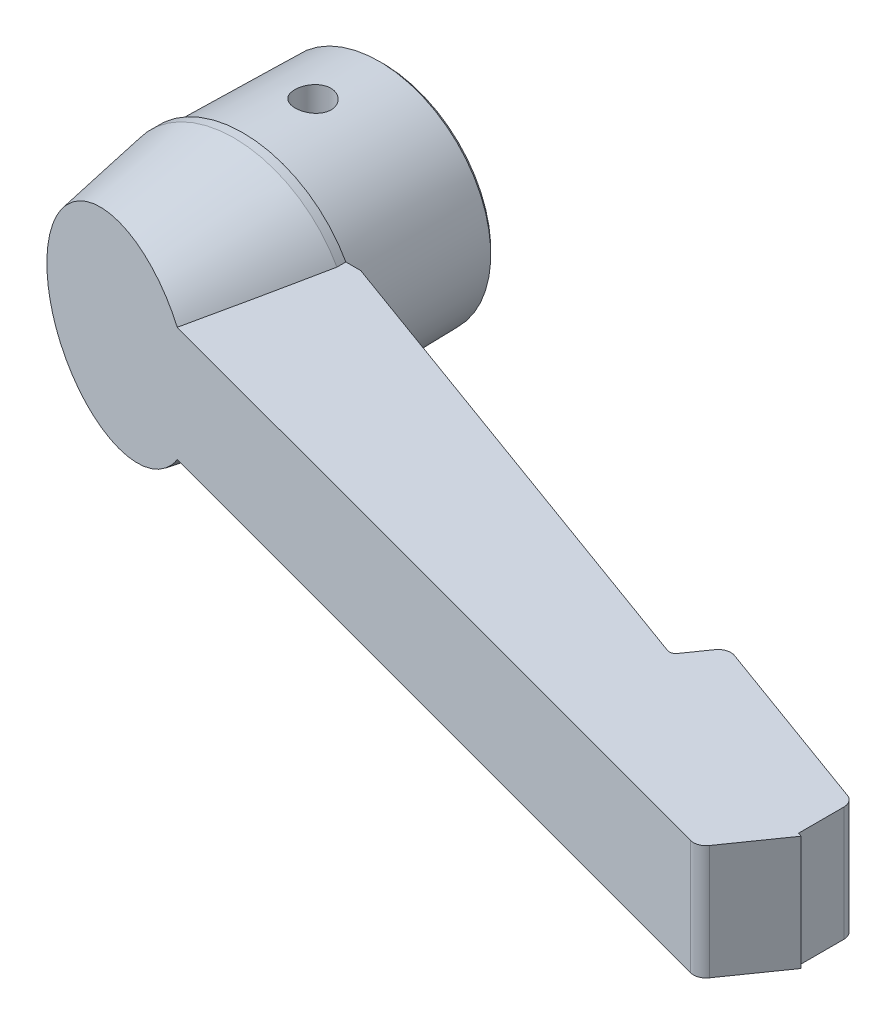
ISO-10303-21;
HEADER;
FILE_DESCRIPTION(('STEP AP214'),'2;1');
FILE_NAME('part.step','',(''),(''),'','','');
FILE_SCHEMA(('AUTOMOTIVE_DESIGN { 1 0 10303 214 1 1 1 1 }'));
ENDSEC;
DATA;
#1=APPLICATION_CONTEXT('core data for automotive mechanical design processes');
#2=APPLICATION_PROTOCOL_DEFINITION('international standard','automotive_design',2000,#1);
#3=PRODUCT_CONTEXT('',#1,'mechanical');
#4=PRODUCT('Part','Part','',(#3));
#5=PRODUCT_RELATED_PRODUCT_CATEGORY('part','',(#4));
#6=PRODUCT_DEFINITION_FORMATION('','',#4);
#7=PRODUCT_DEFINITION_CONTEXT('part definition',#1,'design');
#8=PRODUCT_DEFINITION('design','',#6,#7);
#9=PRODUCT_DEFINITION_SHAPE('','',#8);
#10=(LENGTH_UNIT() NAMED_UNIT(*) SI_UNIT(.MILLI.,.METRE.));
#11=(NAMED_UNIT(*) PLANE_ANGLE_UNIT() SI_UNIT($,.RADIAN.));
#12=(NAMED_UNIT(*) SI_UNIT($,.STERADIAN.) SOLID_ANGLE_UNIT());
#13=UNCERTAINTY_MEASURE_WITH_UNIT(LENGTH_MEASURE(1.E-05),#10,'distance_accuracy_value','');
#14=(GEOMETRIC_REPRESENTATION_CONTEXT(3) GLOBAL_UNCERTAINTY_ASSIGNED_CONTEXT((#13)) GLOBAL_UNIT_ASSIGNED_CONTEXT((#10,
#11,#12)) REPRESENTATION_CONTEXT('',''));
#15=CARTESIAN_POINT('',(0.,0.,0.));
#16=DIRECTION('',(0.,0.,1.));
#17=DIRECTION('',(1.,0.,0.));
#18=AXIS2_PLACEMENT_3D('',#15,#16,#17);
#19=CARTESIAN_POINT('',(0.,0.,11.7000000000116));
#20=DIRECTION('',(0.,0.,-1.));
#21=DIRECTION('',(1.,0.,0.));
#22=AXIS2_PLACEMENT_3D('',#19,#20,#21);
#23=CONICAL_SURFACE('',#22,9.25,0.174532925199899);
#24=CARTESIAN_POINT('',(-0.364622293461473,0.,20.3802042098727));
#25=DIRECTION('',(-0.258755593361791,0.,0.965942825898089));
#26=DIRECTION('',(-0.965942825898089,0.,-0.258755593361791));
#27=AXIS2_PLACEMENT_3D('',#24,#25,#26);
#28=ELLIPSE('',#27,7.99161771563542,7.71082965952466);
#29=CARTESIAN_POINT('',(-6.63315985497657,-4.50000000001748,18.7009959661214));
#30=VERTEX_POINT('',#29);
#31=CARTESIAN_POINT('',(5.90391526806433,-4.5,22.0594124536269));
#32=VERTEX_POINT('',#31);
#33=EDGE_CURVE('E151',#30,#32,#28,.T.);
#34=ORIENTED_EDGE('',*,*,#33,.F.);
#35=CARTESIAN_POINT('',(-10.4043059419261,-4.5,-0.1289646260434));
#36=CARTESIAN_POINT('',(-10.1699332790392,-4.5,1.0908210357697));
#37=CARTESIAN_POINT('',(-9.93442349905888,-4.5,2.31038998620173));
#38=CARTESIAN_POINT('',(-9.46042060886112,-4.5,4.7489472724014));
#39=CARTESIAN_POINT('',(-9.22192749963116,-4.5,5.96793560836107));
#40=CARTESIAN_POINT('',(-8.74077801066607,-4.5,8.40757188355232));
#41=CARTESIAN_POINT('',(-8.4981143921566,-4.5,9.62821839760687));
#42=CARTESIAN_POINT('',(-8.00801096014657,-4.5,12.0685608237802));
#43=CARTESIAN_POINT('',(-7.7605711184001,-4.5,13.2882567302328));
#44=CARTESIAN_POINT('',(-7.25943308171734,-4.5,15.7262432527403));
#45=CARTESIAN_POINT('',(-7.00573550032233,-4.5,16.9445339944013));
#46=CARTESIAN_POINT('',(-6.61870980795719,-4.5,18.7705884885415));
#47=CARTESIAN_POINT('',(-6.48862223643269,-4.5,19.3790390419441));
#48=CARTESIAN_POINT('',(-6.22585644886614,-4.5,20.5953800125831));
#49=CARTESIAN_POINT('',(-6.09317823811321,-4.5,21.2032704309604));
#50=CARTESIAN_POINT('',(-5.82488040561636,-4.5,22.4175270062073));
#51=CARTESIAN_POINT('',(-5.68926507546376,-4.5,23.0238941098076));
#52=CARTESIAN_POINT('',(-5.41420210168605,-4.5,24.2357570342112));
#53=CARTESIAN_POINT('',(-5.27475447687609,-4.5,24.8412528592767));
#54=CARTESIAN_POINT('',(-4.99103385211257,-4.5,26.0511884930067));
#55=CARTESIAN_POINT('',(-4.84676031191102,-4.5,26.6556281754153));
#56=CARTESIAN_POINT('',(-4.55200650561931,-4.5,27.8629896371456));
#57=CARTESIAN_POINT('',(-4.40152630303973,-4.5,28.4659114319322));
#58=CARTESIAN_POINT('',(-4.09204063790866,-4.5,29.6706773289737));
#59=CARTESIAN_POINT('',(-3.93302110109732,-4.5,30.2725178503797));
#60=CARTESIAN_POINT('',(-3.68575149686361,-4.5,31.1727627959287));
#61=CARTESIAN_POINT('',(-3.60188746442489,-4.5,31.4723714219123));
#62=CARTESIAN_POINT('',(-3.43057627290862,-4.5,32.0705844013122));
#63=CARTESIAN_POINT('',(-3.34312891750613,-4.5,32.3691886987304));
#64=CARTESIAN_POINT('',(-3.16365143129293,-4.5,32.965557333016));
#65=CARTESIAN_POINT('',(-3.07161398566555,-4.5,33.2633194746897));
#66=CARTESIAN_POINT('',(-2.88188205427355,-4.5,33.8570035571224));
#67=CARTESIAN_POINT('',(-2.78418841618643,-4.5,34.1529257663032));
#68=CARTESIAN_POINT('',(-2.63194390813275,-4.5,34.5950349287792));
#69=CARTESIAN_POINT('',(-2.58021357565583,-4.5,34.7421933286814));
#70=CARTESIAN_POINT('',(-2.47452726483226,-4.5,35.0357030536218));
#71=CARTESIAN_POINT('',(-2.42057138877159,-4.5,35.1820544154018));
#72=CARTESIAN_POINT('',(-2.30999802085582,-4.5,35.4738370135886));
#73=CARTESIAN_POINT('',(-2.25337922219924,-4.5,35.6192677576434));
#74=CARTESIAN_POINT('',(-2.13689271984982,-4.5,35.9088461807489));
#75=CARTESIAN_POINT('',(-2.07702450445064,-4.5,36.05299365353));
#76=CARTESIAN_POINT('',(-2.01523433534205,-4.5,36.1963316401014));
#77=B_SPLINE_CURVE_WITH_KNOTS('',3,(#35,#36,#37,#38,#39,#40,#41,#42,#43,#44,#45,#46,#47,#48,#49,
#50,#51,#52,#53,#54,#55,#56,#57,#58,#59,#60,#61,#62,#63,#64,#65,#66,#67,#68,#69,#70,#71,#72,#73,
#74,#75,#76),.UNSPECIFIED.,.F.,.F.,(4,2,2,2,2,2,2,2,2,2,2,2,2,2,2,2,2,2,2,2,4),(0.,
3.7262962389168,7.4525912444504,11.1861839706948,14.9197987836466,18.6530489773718,
20.5196494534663,22.386246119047,24.2502782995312,26.1143013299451,27.9785337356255,
29.8427470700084,31.7101333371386,32.6434904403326,33.5768987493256,34.5118452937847,
35.4466520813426,35.9145956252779,36.3825176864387,36.8506718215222,37.318899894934),.UNSPECIFIED.);
#78=CARTESIAN_POINT('',(-8.08161493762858,-4.5,11.7000000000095));
#79=VERTEX_POINT('',#78);
#80=EDGE_CURVE('E159',#30,#79,#77,.F.);
#81=ORIENTED_EDGE('',*,*,#80,.T.);
#82=CARTESIAN_POINT('',(0.,0.,11.7000000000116));
#83=DIRECTION('',(0.,0.,1.));
#84=DIRECTION('',(-1.,0.,0.));
#85=AXIS2_PLACEMENT_3D('',#82,#83,#84);
#86=CIRCLE('',#85,9.25);
#87=CARTESIAN_POINT('',(8.08161493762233,-4.5,11.7000000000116));
#88=VERTEX_POINT('',#87);
#89=EDGE_CURVE('E231',#79,#88,#86,.T.);
#90=ORIENTED_EDGE('',*,*,#89,.T.);
#91=CARTESIAN_POINT('',(10.4043059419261,-4.5,-0.128964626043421));
#92=CARTESIAN_POINT('',(10.1699332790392,-4.5,1.09082103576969));
#93=CARTESIAN_POINT('',(9.93442349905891,-4.5,2.31038998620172));
#94=CARTESIAN_POINT('',(9.46042060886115,-4.5,4.74894727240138));
#95=CARTESIAN_POINT('',(9.22192749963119,-4.5,5.96793560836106));
#96=CARTESIAN_POINT('',(8.74077801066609,-4.5,8.40757188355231));
#97=CARTESIAN_POINT('',(8.49811439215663,-4.5,9.62821839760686));
#98=CARTESIAN_POINT('',(8.00801096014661,-4.5,12.0685608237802));
#99=CARTESIAN_POINT('',(7.76057111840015,-4.5,13.2882567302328));
#100=CARTESIAN_POINT('',(7.25943308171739,-4.5,15.7262432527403));
#101=CARTESIAN_POINT('',(7.00573550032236,-4.5,16.9445339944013));
#102=CARTESIAN_POINT('',(6.61870980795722,-4.5,18.7705884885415));
#103=CARTESIAN_POINT('',(6.48862223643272,-4.5,19.3790390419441));
#104=CARTESIAN_POINT('',(6.22585644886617,-4.5,20.5953800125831));
#105=CARTESIAN_POINT('',(6.09317823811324,-4.5,21.2032704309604));
#106=CARTESIAN_POINT('',(5.82488040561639,-4.5,22.4175270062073));
#107=CARTESIAN_POINT('',(5.68926507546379,-4.5,23.0238941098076));
#108=CARTESIAN_POINT('',(5.41420210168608,-4.5,24.2357570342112));
#109=CARTESIAN_POINT('',(5.27475447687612,-4.5,24.8412528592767));
#110=CARTESIAN_POINT('',(4.9910338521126,-4.5,26.0511884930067));
#111=CARTESIAN_POINT('',(4.84676031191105,-4.5,26.6556281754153));
#112=CARTESIAN_POINT('',(4.55200650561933,-4.5,27.8629896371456));
#113=CARTESIAN_POINT('',(4.40152630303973,-4.5,28.4659114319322));
#114=CARTESIAN_POINT('',(4.09204063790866,-4.5,29.6706773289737));
#115=CARTESIAN_POINT('',(3.93302110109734,-4.5,30.2725178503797));
#116=CARTESIAN_POINT('',(3.68575149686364,-4.5,31.1727627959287));
#117=CARTESIAN_POINT('',(3.60188746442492,-4.5,31.4723714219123));
#118=CARTESIAN_POINT('',(3.43057627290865,-4.5,32.0705844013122));
#119=CARTESIAN_POINT('',(3.34312891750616,-4.5,32.3691886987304));
#120=CARTESIAN_POINT('',(3.16365143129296,-4.5,32.965557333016));
#121=CARTESIAN_POINT('',(3.07161398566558,-4.5,33.2633194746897));
#122=CARTESIAN_POINT('',(2.88188205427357,-4.5,33.8570035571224));
#123=CARTESIAN_POINT('',(2.78418841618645,-4.5,34.1529257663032));
#124=CARTESIAN_POINT('',(2.63194390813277,-4.5,34.5950349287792));
#125=CARTESIAN_POINT('',(2.58021357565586,-4.5,34.7421933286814));
#126=CARTESIAN_POINT('',(2.47452726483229,-4.5,35.0357030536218));
#127=CARTESIAN_POINT('',(2.42057138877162,-4.5,35.1820544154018));
#128=CARTESIAN_POINT('',(2.30999802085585,-4.5,35.4738370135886));
#129=CARTESIAN_POINT('',(2.25337922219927,-4.5,35.6192677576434));
#130=CARTESIAN_POINT('',(2.13689271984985,-4.5,35.9088461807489));
#131=CARTESIAN_POINT('',(2.07702450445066,-4.5,36.05299365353));
#132=CARTESIAN_POINT('',(2.01523433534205,-4.5,36.1963316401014));
#133=B_SPLINE_CURVE_WITH_KNOTS('',3,(#91,#92,#93,#94,#95,#96,#97,#98,#99,#100,#101,#102,#103,
#104,#105,#106,#107,#108,#109,#110,#111,#112,#113,#114,#115,#116,#117,#118,#119,#120,#121,#122,
#123,#124,#125,#126,#127,#128,#129,#130,#131,#132),.UNSPECIFIED.,.F.,.F.,(4,2,2,2,2,2,2,2,2,2,2,
2,2,2,2,2,2,2,2,2,4),(0.,3.72629623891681,7.45259124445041,11.1861839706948,14.9197987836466,
18.6530489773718,20.5196494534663,22.386246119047,24.2502782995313,26.1143013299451,
27.9785337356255,29.8427470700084,31.7101333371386,32.6434904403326,33.5768987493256,
34.5118452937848,35.4466520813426,35.9145956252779,36.3825176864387,36.8506718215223,
37.318899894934),.UNSPECIFIED.);
#134=EDGE_CURVE('E164',#88,#32,#133,.T.);
#135=ORIENTED_EDGE('',*,*,#134,.T.);
#136=EDGE_LOOP('',(#34,#81,#90,#135));
#137=FACE_BOUND('',#136,.T.);
#138=ADVANCED_FACE('F15',(#137),#23,.T.);
#139=CARTESIAN_POINT('',(5.90391526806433,4.5,22.0594124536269));
#140=VERTEX_POINT('',#139);
#141=CARTESIAN_POINT('',(-6.63315985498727,4.5,18.7009959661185));
#142=VERTEX_POINT('',#141);
#143=EDGE_CURVE('E165',#140,#142,#28,.T.);
#144=ORIENTED_EDGE('',*,*,#143,.F.);
#145=CARTESIAN_POINT('',(10.4043059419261,4.5,-0.128964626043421));
#146=CARTESIAN_POINT('',(10.1699332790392,4.5,1.09082103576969));
#147=CARTESIAN_POINT('',(9.93442349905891,4.5,2.31038998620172));
#148=CARTESIAN_POINT('',(9.46042060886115,4.5,4.74894727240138));
#149=CARTESIAN_POINT('',(9.22192749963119,4.5,5.96793560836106));
#150=CARTESIAN_POINT('',(8.74077801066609,4.5,8.40757188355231));
#151=CARTESIAN_POINT('',(8.49811439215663,4.5,9.62821839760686));
#152=CARTESIAN_POINT('',(8.00801096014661,4.5,12.0685608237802));
#153=CARTESIAN_POINT('',(7.76057111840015,4.5,13.2882567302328));
#154=CARTESIAN_POINT('',(7.25943308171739,4.5,15.7262432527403));
#155=CARTESIAN_POINT('',(7.00573550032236,4.5,16.9445339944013));
#156=CARTESIAN_POINT('',(6.61870980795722,4.5,18.7705884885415));
#157=CARTESIAN_POINT('',(6.48862223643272,4.5,19.3790390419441));
#158=CARTESIAN_POINT('',(6.22585644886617,4.5,20.5953800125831));
#159=CARTESIAN_POINT('',(6.09317823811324,4.5,21.2032704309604));
#160=CARTESIAN_POINT('',(5.82488040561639,4.5,22.4175270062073));
#161=CARTESIAN_POINT('',(5.68926507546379,4.5,23.0238941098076));
#162=CARTESIAN_POINT('',(5.41420210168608,4.5,24.2357570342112));
#163=CARTESIAN_POINT('',(5.27475447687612,4.5,24.8412528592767));
#164=CARTESIAN_POINT('',(4.9910338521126,4.5,26.0511884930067));
#165=CARTESIAN_POINT('',(4.84676031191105,4.5,26.6556281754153));
#166=CARTESIAN_POINT('',(4.55200650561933,4.5,27.8629896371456));
#167=CARTESIAN_POINT('',(4.40152630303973,4.5,28.4659114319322));
#168=CARTESIAN_POINT('',(4.09204063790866,4.5,29.6706773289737));
#169=CARTESIAN_POINT('',(3.93302110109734,4.5,30.2725178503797));
#170=CARTESIAN_POINT('',(3.68575149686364,4.5,31.1727627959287));
#171=CARTESIAN_POINT('',(3.60188746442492,4.5,31.4723714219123));
#172=CARTESIAN_POINT('',(3.43057627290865,4.5,32.0705844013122));
#173=CARTESIAN_POINT('',(3.34312891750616,4.5,32.3691886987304));
#174=CARTESIAN_POINT('',(3.16365143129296,4.5,32.965557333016));
#175=CARTESIAN_POINT('',(3.07161398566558,4.5,33.2633194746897));
#176=CARTESIAN_POINT('',(2.88188205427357,4.5,33.8570035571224));
#177=CARTESIAN_POINT('',(2.78418841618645,4.5,34.1529257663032));
#178=CARTESIAN_POINT('',(2.63194390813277,4.5,34.5950349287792));
#179=CARTESIAN_POINT('',(2.58021357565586,4.5,34.7421933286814));
#180=CARTESIAN_POINT('',(2.47452726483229,4.5,35.0357030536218));
#181=CARTESIAN_POINT('',(2.42057138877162,4.5,35.1820544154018));
#182=CARTESIAN_POINT('',(2.30999802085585,4.5,35.4738370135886));
#183=CARTESIAN_POINT('',(2.25337922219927,4.5,35.6192677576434));
#184=CARTESIAN_POINT('',(2.13689271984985,4.5,35.9088461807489));
#185=CARTESIAN_POINT('',(2.07702450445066,4.5,36.05299365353));
#186=CARTESIAN_POINT('',(2.01523433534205,4.5,36.1963316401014));
#187=B_SPLINE_CURVE_WITH_KNOTS('',3,(#145,#146,#147,#148,#149,#150,#151,#152,#153,#154,#155,
#156,#157,#158,#159,#160,#161,#162,#163,#164,#165,#166,#167,#168,#169,#170,#171,#172,#173,#174,
#175,#176,#177,#178,#179,#180,#181,#182,#183,#184,#185,#186),.UNSPECIFIED.,.F.,.F.,(4,2,2,2,2,2,
2,2,2,2,2,2,2,2,2,2,2,2,2,2,4),(0.,3.72629623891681,7.45259124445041,11.1861839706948,
14.9197987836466,18.6530489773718,20.5196494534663,22.386246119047,24.2502782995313,
26.1143013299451,27.9785337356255,29.8427470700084,31.7101333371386,32.6434904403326,
33.5768987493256,34.5118452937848,35.4466520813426,35.9145956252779,36.3825176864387,
36.8506718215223,37.318899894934),.UNSPECIFIED.);
#188=CARTESIAN_POINT('',(8.08161493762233,4.5,11.7000000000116));
#189=VERTEX_POINT('',#188);
#190=EDGE_CURVE('E246',#189,#140,#187,.T.);
#191=ORIENTED_EDGE('',*,*,#190,.F.);
#192=CARTESIAN_POINT('',(-8.08161493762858,4.5,11.7000000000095));
#193=VERTEX_POINT('',#192);
#194=EDGE_CURVE('E233',#189,#193,#86,.T.);
#195=ORIENTED_EDGE('',*,*,#194,.T.);
#196=CARTESIAN_POINT('',(-10.4043059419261,4.5,-0.1289646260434));
#197=CARTESIAN_POINT('',(-10.1699332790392,4.5,1.0908210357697));
#198=CARTESIAN_POINT('',(-9.93442349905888,4.5,2.31038998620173));
#199=CARTESIAN_POINT('',(-9.46042060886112,4.5,4.7489472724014));
#200=CARTESIAN_POINT('',(-9.22192749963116,4.5,5.96793560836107));
#201=CARTESIAN_POINT('',(-8.74077801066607,4.5,8.40757188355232));
#202=CARTESIAN_POINT('',(-8.4981143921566,4.5,9.62821839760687));
#203=CARTESIAN_POINT('',(-8.00801096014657,4.5,12.0685608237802));
#204=CARTESIAN_POINT('',(-7.7605711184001,4.5,13.2882567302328));
#205=CARTESIAN_POINT('',(-7.25943308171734,4.5,15.7262432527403));
#206=CARTESIAN_POINT('',(-7.00573550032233,4.5,16.9445339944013));
#207=CARTESIAN_POINT('',(-6.61870980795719,4.5,18.7705884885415));
#208=CARTESIAN_POINT('',(-6.48862223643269,4.5,19.3790390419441));
#209=CARTESIAN_POINT('',(-6.22585644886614,4.5,20.5953800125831));
#210=CARTESIAN_POINT('',(-6.09317823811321,4.5,21.2032704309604));
#211=CARTESIAN_POINT('',(-5.82488040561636,4.5,22.4175270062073));
#212=CARTESIAN_POINT('',(-5.68926507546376,4.5,23.0238941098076));
#213=CARTESIAN_POINT('',(-5.41420210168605,4.5,24.2357570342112));
#214=CARTESIAN_POINT('',(-5.27475447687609,4.5,24.8412528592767));
#215=CARTESIAN_POINT('',(-4.99103385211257,4.5,26.0511884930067));
#216=CARTESIAN_POINT('',(-4.84676031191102,4.5,26.6556281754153));
#217=CARTESIAN_POINT('',(-4.55200650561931,4.5,27.8629896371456));
#218=CARTESIAN_POINT('',(-4.40152630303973,4.5,28.4659114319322));
#219=CARTESIAN_POINT('',(-4.09204063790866,4.5,29.6706773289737));
#220=CARTESIAN_POINT('',(-3.93302110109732,4.5,30.2725178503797));
#221=CARTESIAN_POINT('',(-3.68575149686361,4.5,31.1727627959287));
#222=CARTESIAN_POINT('',(-3.60188746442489,4.5,31.4723714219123));
#223=CARTESIAN_POINT('',(-3.43057627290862,4.5,32.0705844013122));
#224=CARTESIAN_POINT('',(-3.34312891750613,4.5,32.3691886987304));
#225=CARTESIAN_POINT('',(-3.16365143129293,4.5,32.965557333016));
#226=CARTESIAN_POINT('',(-3.07161398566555,4.5,33.2633194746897));
#227=CARTESIAN_POINT('',(-2.88188205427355,4.5,33.8570035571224));
#228=CARTESIAN_POINT('',(-2.78418841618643,4.5,34.1529257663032));
#229=CARTESIAN_POINT('',(-2.63194390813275,4.5,34.5950349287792));
#230=CARTESIAN_POINT('',(-2.58021357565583,4.5,34.7421933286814));
#231=CARTESIAN_POINT('',(-2.47452726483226,4.5,35.0357030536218));
#232=CARTESIAN_POINT('',(-2.42057138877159,4.5,35.1820544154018));
#233=CARTESIAN_POINT('',(-2.30999802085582,4.5,35.4738370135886));
#234=CARTESIAN_POINT('',(-2.25337922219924,4.5,35.6192677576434));
#235=CARTESIAN_POINT('',(-2.13689271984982,4.5,35.9088461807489));
#236=CARTESIAN_POINT('',(-2.07702450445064,4.5,36.05299365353));
#237=CARTESIAN_POINT('',(-2.01523433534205,4.5,36.1963316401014));
#238=B_SPLINE_CURVE_WITH_KNOTS('',3,(#196,#197,#198,#199,#200,#201,#202,#203,#204,#205,#206,
#207,#208,#209,#210,#211,#212,#213,#214,#215,#216,#217,#218,#219,#220,#221,#222,#223,#224,#225,
#226,#227,#228,#229,#230,#231,#232,#233,#234,#235,#236,#237),.UNSPECIFIED.,.F.,.F.,(4,2,2,2,2,2,
2,2,2,2,2,2,2,2,2,2,2,2,2,2,4),(0.,3.7262962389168,7.4525912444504,11.1861839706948,
14.9197987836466,18.6530489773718,20.5196494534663,22.386246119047,24.2502782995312,
26.1143013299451,27.9785337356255,29.8427470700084,31.7101333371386,32.6434904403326,
33.5768987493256,34.5118452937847,35.4466520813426,35.9145956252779,36.3825176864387,
36.8506718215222,37.318899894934),.UNSPECIFIED.);
#239=EDGE_CURVE('E172',#142,#193,#238,.F.);
#240=ORIENTED_EDGE('',*,*,#239,.F.);
#241=EDGE_LOOP('',(#144,#191,#195,#240));
#242=FACE_BOUND('',#241,.T.);
#243=ADVANCED_FACE('F242',(#242),#23,.T.);
#244=CARTESIAN_POINT('',(-7.46865004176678,3.016998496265,18.4771858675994));
#245=VERTEX_POINT('',#244);
#246=CARTESIAN_POINT('',(-7.46865004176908,-3.01699849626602,18.4771858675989));
#247=VERTEX_POINT('',#246);
#248=EDGE_CURVE('E154',#245,#247,#28,.T.);
#249=ORIENTED_EDGE('',*,*,#248,.F.);
#250=CARTESIAN_POINT('',(-8.19470220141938,0.,17.6848912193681));
#251=CARTESIAN_POINT('',(-8.19435632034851,0.00574576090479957,17.6868527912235));
#252=CARTESIAN_POINT('',(-8.1940045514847,0.0114916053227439,17.6888135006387));
#253=CARTESIAN_POINT('',(-8.17388956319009,0.334649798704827,17.7990363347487));
#254=CARTESIAN_POINT('',(-8.13617028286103,0.652293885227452,17.9045827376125));
#255=CARTESIAN_POINT('',(-8.05306233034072,1.12732804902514,18.0518419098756));
#256=CARTESIAN_POINT('',(-8.020919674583,1.28549822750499,18.0991018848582));
#257=CARTESIAN_POINT('',(-7.94780898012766,1.60120670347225,18.1886057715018));
#258=CARTESIAN_POINT('',(-7.9068432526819,1.75874515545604,18.2308509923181));
#259=CARTESIAN_POINT('',(-7.80800193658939,2.10109018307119,18.3157560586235));
#260=CARTESIAN_POINT('',(-7.74841220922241,2.28573192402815,18.3571374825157));
#261=CARTESIAN_POINT('',(-7.65007190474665,2.56127498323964,18.4099236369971));
#262=CARTESIAN_POINT('',(-7.61579169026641,2.65290365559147,18.4259735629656));
#263=CARTESIAN_POINT('',(-7.54430010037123,2.83562331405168,18.4544553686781));
#264=CARTESIAN_POINT('',(-7.50708741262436,2.92671403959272,18.4668856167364));
#265=CARTESIAN_POINT('',(-7.46845004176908,3.01746834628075,18.4772394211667));
#266=B_SPLINE_CURVE_WITH_KNOTS('',3,(#250,#251,#252,#253,#254,#255,#256,#257,#258,#259,#260,
#261,#262,#263,#264,#265),.UNSPECIFIED.,.F.,.F.,(4,2,2,2,2,2,2,4),(0.,0.0182440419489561,
1.02606914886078,1.53039261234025,2.03458412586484,2.62899370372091,2.92631348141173,
3.22376707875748),.UNSPECIFIED.);
#267=CARTESIAN_POINT('',(-8.19470220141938,0.,17.6848912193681));
#268=VERTEX_POINT('',#267);
#269=EDGE_CURVE('E29',#268,#245,#266,.T.);
#270=ORIENTED_EDGE('',*,*,#269,.F.);
#271=CARTESIAN_POINT('',(-7.46845004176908,-3.01746834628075,18.4772394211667));
#272=CARTESIAN_POINT('',(-7.50146639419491,-2.9399146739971,18.4683956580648));
#273=CARTESIAN_POINT('',(-7.53344502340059,-2.86211210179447,18.4580300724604));
#274=CARTESIAN_POINT('',(-7.59527255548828,-2.70608999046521,18.4345950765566));
#275=CARTESIAN_POINT('',(-7.62512198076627,-2.62787055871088,18.4215263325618));
#276=CARTESIAN_POINT('',(-7.71135640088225,-2.39282050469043,18.378797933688));
#277=CARTESIAN_POINT('',(-7.76449922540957,-2.23542993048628,18.3455954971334));
#278=CARTESIAN_POINT('',(-7.86174883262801,-1.92018267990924,18.2720257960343));
#279=CARTESIAN_POINT('',(-7.90588488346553,-1.7623292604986,18.2316825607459));
#280=CARTESIAN_POINT('',(-7.9852809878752,-1.44590074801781,18.1454436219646));
#281=CARTESIAN_POINT('',(-8.02054000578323,-1.28732557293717,18.0995472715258));
#282=CARTESIAN_POINT('',(-8.08718008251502,-0.943713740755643,17.9957741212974));
#283=CARTESIAN_POINT('',(-8.11698257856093,-0.758592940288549,17.9371658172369));
#284=CARTESIAN_POINT('',(-8.1644432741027,-0.388058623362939,17.8162839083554));
#285=CARTESIAN_POINT('',(-8.18210624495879,-0.202645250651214,17.7540117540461));
#286=CARTESIAN_POINT('',(-8.19400454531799,-0.0114916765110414,17.688813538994));
#287=CARTESIAN_POINT('',(-8.19435631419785,-0.00574583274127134,17.6868528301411));
#288=CARTESIAN_POINT('',(-8.19470220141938,0.,17.6848912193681));
#289=B_SPLINE_CURVE_WITH_KNOTS('',3,(#271,#272,#273,#274,#275,#276,#277,#278,#279,#280,#281,
#282,#283,#284,#285,#286,#287,#288),.UNSPECIFIED.,.F.,.F.,(4,2,2,2,2,2,2,2,4),(0.,
0.254205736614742,0.50834888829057,1.01608476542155,1.52214348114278,2.02826121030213,
2.6171936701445,3.20589452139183,3.2241385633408),.UNSPECIFIED.);
#290=EDGE_CURVE('E9',#247,#268,#289,.T.);
#291=ORIENTED_EDGE('',*,*,#290,.F.);
#292=EDGE_LOOP('',(#249,#270,#291));
#293=FACE_BOUND('',#292,.T.);
#294=ADVANCED_FACE('F386',(#293),#23,.T.);
#295=CARTESIAN_POINT('',(0.,0.,23.0660236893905));
#296=DIRECTION('',(0.,0.,1.));
#297=DIRECTION('',(-1.,0.,0.));
#298=AXIS2_PLACEMENT_3D('',#295,#296,#297);
#299=CYLINDRICAL_SURFACE('',#298,3.99999999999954);
#300=CARTESIAN_POINT('',(1.40000000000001,3.74699879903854,5.5));
#301=CARTESIAN_POINT('',(1.40000122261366,3.74699776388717,5.57600609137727));
#302=CARTESIAN_POINT('',(1.39378962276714,3.74933664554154,5.65200366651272));
#303=CARTESIAN_POINT('',(1.36920227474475,3.75838443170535,5.80173169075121));
#304=CARTESIAN_POINT('',(1.35082551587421,3.76509369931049,5.8754619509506));
#305=CARTESIAN_POINT('',(1.30264502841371,3.78203119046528,6.01845867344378));
#306=CARTESIAN_POINT('',(1.27286558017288,3.79225193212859,6.08773425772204));
#307=CARTESIAN_POINT('',(1.20280928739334,3.81504942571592,6.22033070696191));
#308=CARTESIAN_POINT('',(1.16252977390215,3.82762677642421,6.28365005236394));
#309=CARTESIAN_POINT('',(1.07075317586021,3.85432936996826,6.40527144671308));
#310=CARTESIAN_POINT('',(1.0188779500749,3.86849598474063,6.46327913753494));
#311=CARTESIAN_POINT('',(0.906187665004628,3.89643301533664,6.56997499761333));
#312=CARTESIAN_POINT('',(0.845371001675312,3.91020335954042,6.61866149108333));
#313=CARTESIAN_POINT('',(0.714340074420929,3.93628022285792,6.70670005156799));
#314=CARTESIAN_POINT('',(0.643903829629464,3.9485324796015,6.74573923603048));
#315=CARTESIAN_POINT('',(0.49696057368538,3.96970144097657,6.81129584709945));
#316=CARTESIAN_POINT('',(0.420455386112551,3.97861914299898,6.83781701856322));
#317=CARTESIAN_POINT('',(0.266635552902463,3.99182093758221,6.87657343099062));
#318=CARTESIAN_POINT('',(0.189462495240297,3.99626844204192,6.88931389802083));
#319=CARTESIAN_POINT('',(0.0339542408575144,4.00061125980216,6.9017584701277));
#320=CARTESIAN_POINT('',(-0.0443806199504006,4.00050786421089,6.90146627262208));
#321=CARTESIAN_POINT('',(-0.196395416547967,3.99586865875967,6.88816415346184));
#322=CARTESIAN_POINT('',(-0.270130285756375,3.9915244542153,6.87570398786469));
#323=CARTESIAN_POINT('',(-0.41438738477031,3.97913646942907,6.83933478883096));
#324=CARTESIAN_POINT('',(-0.484909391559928,3.97109243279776,6.81542496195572));
#325=CARTESIAN_POINT('',(-0.621885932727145,3.95197547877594,6.75654027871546));
#326=CARTESIAN_POINT('',(-0.688271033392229,3.94086235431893,6.72141749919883));
#327=CARTESIAN_POINT('',(-0.814360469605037,3.91675169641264,6.64122901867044));
#328=CARTESIAN_POINT('',(-0.874062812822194,3.90375360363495,6.59616036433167));
#329=CARTESIAN_POINT('',(-0.988351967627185,3.87644049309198,6.4946351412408));
#330=CARTESIAN_POINT('',(-1.0425162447,3.86209212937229,6.437711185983));
#331=CARTESIAN_POINT('',(-1.14067551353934,3.83424945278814,6.31547840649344));
#332=CARTESIAN_POINT('',(-1.18466858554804,3.82075530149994,6.25016800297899));
#333=CARTESIAN_POINT('',(-1.2619046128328,3.79595529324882,6.1115519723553));
#334=CARTESIAN_POINT('',(-1.2949505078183,3.78469088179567,6.03812855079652));
#335=CARTESIAN_POINT('',(-1.34805902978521,3.76610381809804,5.88626346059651));
#336=CARTESIAN_POINT('',(-1.36812777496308,3.75877930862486,5.8078241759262));
#337=CARTESIAN_POINT('',(-1.39381332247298,3.74932842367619,5.65228130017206));
#338=CARTESIAN_POINT('',(-1.40009174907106,3.7469643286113,5.57530144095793));
#339=CARTESIAN_POINT('',(-1.39990627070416,3.74703400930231,5.42136833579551));
#340=CARTESIAN_POINT('',(-1.39344499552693,3.74946679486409,5.34441508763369));
#341=CARTESIAN_POINT('',(-1.36856033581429,3.75861734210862,5.19587275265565));
#342=CARTESIAN_POINT('',(-1.35061603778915,3.76516330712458,5.12419165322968));
#343=CARTESIAN_POINT('',(-1.30386027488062,3.78160789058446,4.98487877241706));
#344=CARTESIAN_POINT('',(-1.27504676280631,3.79150714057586,4.91724775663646));
#345=CARTESIAN_POINT('',(-1.20625806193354,3.81395980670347,4.78539622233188));
#346=CARTESIAN_POINT('',(-1.16593582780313,3.82659220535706,4.72137058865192));
#347=CARTESIAN_POINT('',(-1.07565800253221,3.85294274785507,4.60075662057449));
#348=CARTESIAN_POINT('',(-1.02569929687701,3.86666124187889,4.54417070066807));
#349=CARTESIAN_POINT('',(-0.914372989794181,3.89453247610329,4.4368850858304));
#350=CARTESIAN_POINT('',(-0.85253555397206,3.90866876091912,4.38666712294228));
#351=CARTESIAN_POINT('',(-0.720962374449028,3.93506149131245,4.29727927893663));
#352=CARTESIAN_POINT('',(-0.651226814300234,3.94731798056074,4.25810914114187));
#353=CARTESIAN_POINT('',(-0.506086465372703,3.96852854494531,4.19225829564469));
#354=CARTESIAN_POINT('',(-0.430716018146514,3.97750092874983,4.1655081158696));
#355=CARTESIAN_POINT('',(-0.276165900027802,3.9912077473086,4.12518976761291));
#356=CARTESIAN_POINT('',(-0.196987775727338,3.99594388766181,4.11161629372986));
#357=CARTESIAN_POINT('',(-0.0414547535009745,4.00050291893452,4.09855183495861));
#358=CARTESIAN_POINT('',(0.0348358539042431,4.00056602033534,4.09837234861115));
#359=CARTESIAN_POINT('',(0.186310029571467,3.99637680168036,4.11037443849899));
#360=CARTESIAN_POINT('',(0.261493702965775,3.99212489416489,4.12255483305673));
#361=CARTESIAN_POINT('',(0.407185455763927,3.97988049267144,4.15846187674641));
#362=CARTESIAN_POINT('',(0.477755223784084,3.97196059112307,4.18196479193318));
#363=CARTESIAN_POINT('',(0.613969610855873,3.9531978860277,4.23963708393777));
#364=CARTESIAN_POINT('',(0.679613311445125,3.9423545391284,4.27380844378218));
#365=CARTESIAN_POINT('',(0.806920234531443,3.91832128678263,4.35338175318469));
#366=CARTESIAN_POINT('',(0.868326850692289,3.90505610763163,4.399171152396));
#367=CARTESIAN_POINT('',(0.982805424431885,3.87782955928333,4.50004106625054));
#368=CARTESIAN_POINT('',(1.03587457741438,3.863867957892,4.55512469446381));
#369=CARTESIAN_POINT('',(1.13457718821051,3.83607648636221,4.67593483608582));
#370=CARTESIAN_POINT('',(1.17977638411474,3.82227993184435,4.74202506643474));
#371=CARTESIAN_POINT('',(1.25841220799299,3.79711875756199,4.88129908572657));
#372=CARTESIAN_POINT('',(1.2918503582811,3.78575382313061,4.95448195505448));
#373=CARTESIAN_POINT('',(1.34550733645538,3.76701681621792,5.10512171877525));
#374=CARTESIAN_POINT('',(1.36586857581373,3.75960188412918,5.18252225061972));
#375=CARTESIAN_POINT('',(1.39311123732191,3.74959450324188,5.33995246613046));
#376=CARTESIAN_POINT('',(1.39999871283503,3.74699988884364,5.41998095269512));
#377=CARTESIAN_POINT('',(1.40000000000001,3.74699879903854,5.5));
#378=B_SPLINE_CURVE_WITH_KNOTS('',3,(#300,#301,#302,#303,#304,#305,#306,#307,#308,#309,#310,
#311,#312,#313,#314,#315,#316,#317,#318,#319,#320,#321,#322,#323,#324,#325,#326,#327,#328,#329,
#330,#331,#332,#333,#334,#335,#336,#337,#338,#339,#340,#341,#342,#343,#344,#345,#346,#347,#348,
#349,#350,#351,#352,#353,#354,#355,#356,#357,#358,#359,#360,#361,#362,#363,#364,#365,#366,#367,
#368,#369,#370,#371,#372,#373,#374,#375,#376,#377),.UNSPECIFIED.,.T.,.F.,(4,2,2,2,2,2,2,2,2,2,2,
2,2,2,2,2,2,2,2,2,2,2,2,2,2,2,2,2,2,2,2,2,2,2,2,2,2,2,4),(0.,0.227721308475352,
0.455461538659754,0.682719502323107,0.910035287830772,1.14627052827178,1.38254819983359,
1.62570198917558,1.86878299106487,2.10261389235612,2.33637845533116,2.5600479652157,
2.7837329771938,3.01050009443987,3.23733463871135,3.47586603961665,3.71444242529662,
3.95710565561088,4.19965439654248,4.43028591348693,4.66086982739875,4.88241035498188,
5.10399263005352,5.33312933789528,5.56234022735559,5.80390693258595,6.04546802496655,
6.28566114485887,6.52575751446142,6.75350304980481,6.9812268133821,7.20462462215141,
7.42806398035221,7.66025483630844,7.89252363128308,8.13509557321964,8.37763610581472,
8.61748838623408,8.85723288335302),.UNSPECIFIED.);
#379=CARTESIAN_POINT('',(1.40000000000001,3.74699879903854,5.5));
#380=VERTEX_POINT('',#379);
#381=EDGE_CURVE('E347',#380,#380,#378,.T.);
#382=ORIENTED_EDGE('',*,*,#381,.F.);
#383=EDGE_LOOP('',(#382));
#384=FACE_BOUND('',#383,.T.);
#385=CARTESIAN_POINT('',(0.,0.,0.299999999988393));
#386=DIRECTION('',(0.,0.,1.));
#387=DIRECTION('',(-1.,0.,0.));
#388=AXIS2_PLACEMENT_3D('',#385,#386,#387);
#389=CIRCLE('',#388,3.99999999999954);
#390=CARTESIAN_POINT('',(-3.99999999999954,0.,0.299999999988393));
#391=VERTEX_POINT('',#390);
#392=EDGE_CURVE('E214',#391,#391,#389,.T.);
#393=ORIENTED_EDGE('',*,*,#392,.F.);
#394=EDGE_LOOP('',(#393));
#395=FACE_BOUND('',#394,.T.);
#396=CARTESIAN_POINT('',(0.,0.,16.));
#397=DIRECTION('',(0.,0.,-1.));
#398=DIRECTION('',(-1.,0.,0.));
#399=AXIS2_PLACEMENT_3D('',#396,#397,#398);
#400=CIRCLE('',#399,3.99999999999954);
#401=CARTESIAN_POINT('',(-3.99999999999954,0.,16.));
#402=VERTEX_POINT('',#401);
#403=EDGE_CURVE('E353',#402,#402,#400,.T.);
#404=ORIENTED_EDGE('',*,*,#403,.F.);
#405=EDGE_LOOP('',(#404));
#406=FACE_BOUND('',#405,.T.);
#407=ADVANCED_FACE('F354',(#384,#395,#406),#299,.F.);
#408=CARTESIAN_POINT('',(0.,0.,0.));
#409=DIRECTION('',(0.,0.,-1.));
#410=DIRECTION('',(1.,0.,0.));
#411=AXIS2_PLACEMENT_3D('',#408,#409,#410);
#412=CONICAL_SURFACE('',#411,4.29999999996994,0.785398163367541);
#413=ORIENTED_EDGE('',*,*,#392,.T.);
#414=EDGE_LOOP('',(#413));
#415=FACE_BOUND('',#414,.T.);
#416=CARTESIAN_POINT('',(0.,0.,0.));
#417=DIRECTION('',(0.,0.,1.));
#418=DIRECTION('',(-1.,0.,0.));
#419=AXIS2_PLACEMENT_3D('',#416,#417,#418);
#420=CIRCLE('',#419,4.29999999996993);
#421=CARTESIAN_POINT('',(-4.29999999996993,0.,0.));
#422=VERTEX_POINT('',#421);
#423=EDGE_CURVE('E217',#422,#422,#420,.T.);
#424=ORIENTED_EDGE('',*,*,#423,.F.);
#425=EDGE_LOOP('',(#424));
#426=FACE_BOUND('',#425,.T.);
#427=ADVANCED_FACE('F397',(#415,#426),#412,.F.);
#428=CARTESIAN_POINT('',(-8.46323080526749,0.,0.));
#429=DIRECTION('',(0.,0.,-1.));
#430=DIRECTION('',(1.,0.,0.));
#431=AXIS2_PLACEMENT_3D('',#428,#429,#430);
#432=PLANE('',#431);
#433=ORIENTED_EDGE('',*,*,#423,.T.);
#434=EDGE_LOOP('',(#433));
#435=FACE_BOUND('',#434,.T.);
#436=CARTESIAN_POINT('',(0.,0.,0.));
#437=DIRECTION('',(0.,0.,1.));
#438=DIRECTION('',(-1.,0.,0.));
#439=AXIS2_PLACEMENT_3D('',#436,#437,#438);
#440=CIRCLE('',#439,8.46323080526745);
#441=CARTESIAN_POINT('',(-8.46323080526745,0.,0.));
#442=VERTEX_POINT('',#441);
#443=EDGE_CURVE('E220',#442,#442,#440,.T.);
#444=ORIENTED_EDGE('',*,*,#443,.F.);
#445=EDGE_LOOP('',(#444));
#446=FACE_BOUND('',#445,.T.);
#447=ADVANCED_FACE('F481',(#435,#446),#432,.T.);
#448=CARTESIAN_POINT('',(0.,0.,0.300000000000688));
#449=DIRECTION('',(0.,0.,1.));
#450=DIRECTION('',(-1.,0.,0.));
#451=AXIS2_PLACEMENT_3D('',#448,#449,#450);
#452=CONICAL_SURFACE('',#451,8.76323080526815,0.785398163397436);
#453=ORIENTED_EDGE('',*,*,#443,.T.);
#454=EDGE_LOOP('',(#453));
#455=FACE_BOUND('',#454,.T.);
#456=CARTESIAN_POINT('',(0.,0.,0.300000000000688));
#457=DIRECTION('',(0.,0.,1.));
#458=DIRECTION('',(-1.,0.,0.));
#459=AXIS2_PLACEMENT_3D('',#456,#457,#458);
#460=CIRCLE('',#459,8.76323080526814);
#461=CARTESIAN_POINT('',(-8.76323080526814,0.,0.300000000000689));
#462=VERTEX_POINT('',#461);
#463=EDGE_CURVE('E223',#462,#462,#460,.T.);
#464=ORIENTED_EDGE('',*,*,#463,.F.);
#465=EDGE_LOOP('',(#464));
#466=FACE_BOUND('',#465,.T.);
#467=ADVANCED_FACE('F477',(#455,#466),#452,.T.);
#468=CARTESIAN_POINT('',(0.,0.,11.));
#469=DIRECTION('',(0.,0.,1.));
#470=DIRECTION('',(-1.,0.,0.));
#471=AXIS2_PLACEMENT_3D('',#468,#469,#470);
#472=CONICAL_SURFACE('',#471,8.95,0.0174532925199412);
#473=CARTESIAN_POINT('',(-1.00201528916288,8.7799379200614,4.52226518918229));
#474=CARTESIAN_POINT('',(-1.05674119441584,8.7746777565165,4.57835419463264));
#475=CARTESIAN_POINT('',(-1.10678305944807,8.76951651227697,4.63908317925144));
#476=CARTESIAN_POINT('',(-1.19605775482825,8.76006207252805,4.76814433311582));
#477=CARTESIAN_POINT('',(-1.23528090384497,8.75576965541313,4.83648323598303));
#478=CARTESIAN_POINT('',(-1.30175367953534,8.74864670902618,4.97884148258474));
#479=CARTESIAN_POINT('',(-1.32900258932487,8.74581626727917,5.05286116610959));
#480=CARTESIAN_POINT('',(-1.3707037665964,8.74205650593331,5.20445074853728));
#481=CARTESIAN_POINT('',(-1.38515919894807,8.74112671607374,5.28201976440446));
#482=CARTESIAN_POINT('',(-1.40079631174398,8.74138989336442,5.43788695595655));
#483=CARTESIAN_POINT('',(-1.40207755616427,8.74256685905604,5.51617517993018));
#484=CARTESIAN_POINT('',(-1.39160451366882,8.74699078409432,5.67181549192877));
#485=CARTESIAN_POINT('',(-1.37984996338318,8.75023778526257,5.74916756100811));
#486=CARTESIAN_POINT('',(-1.34372214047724,8.75853154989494,5.90056701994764));
#487=CARTESIAN_POINT('',(-1.31937867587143,8.76357405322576,5.97462176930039));
#488=CARTESIAN_POINT('',(-1.25881264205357,8.77499909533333,6.11759136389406));
#489=CARTESIAN_POINT('',(-1.2225892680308,8.78138172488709,6.18650586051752));
#490=CARTESIAN_POINT('',(-1.13883039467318,8.79495320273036,6.31805317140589));
#491=CARTESIAN_POINT('',(-1.09117654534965,8.80215003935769,6.38060980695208));
#492=CARTESIAN_POINT('',(-0.98608752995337,8.81658297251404,6.49688159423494));
#493=CARTESIAN_POINT('',(-0.928651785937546,8.82381907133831,6.55059622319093));
#494=CARTESIAN_POINT('',(-0.805038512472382,8.83766638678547,6.64811211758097));
#495=CARTESIAN_POINT('',(-0.738791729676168,8.84427185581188,6.69182649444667));
#496=CARTESIAN_POINT('',(-0.599775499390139,8.85610845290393,6.76749003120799));
#497=CARTESIAN_POINT('',(-0.527006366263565,8.86133964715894,6.79943975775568));
#498=CARTESIAN_POINT('',(-0.377550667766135,8.86985018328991,6.85042380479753));
#499=CARTESIAN_POINT('',(-0.300895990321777,8.87314327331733,6.8695492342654));
#500=CARTESIAN_POINT('',(-0.145403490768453,8.87749064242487,6.8946535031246));
#501=CARTESIAN_POINT('',(-0.0665658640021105,8.87854512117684,6.90063351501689));
#502=CARTESIAN_POINT('',(0.089968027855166,8.87830624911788,6.89926886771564));
#503=CARTESIAN_POINT('',(0.16766588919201,8.87704303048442,6.89209521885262));
#504=CARTESIAN_POINT('',(0.320731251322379,8.87235803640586,6.86498081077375));
#505=CARTESIAN_POINT('',(0.396098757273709,8.86893626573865,6.84504007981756));
#506=CARTESIAN_POINT('',(0.54237970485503,8.86028385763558,6.79300051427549));
#507=CARTESIAN_POINT('',(0.613294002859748,8.85505356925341,6.7609040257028));
#508=CARTESIAN_POINT('',(0.748759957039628,8.84330856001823,6.68548290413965));
#509=CARTESIAN_POINT('',(0.813311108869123,8.83679373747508,6.64215738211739));
#510=CARTESIAN_POINT('',(0.93510222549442,8.8230352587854,6.54486154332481));
#511=CARTESIAN_POINT('',(0.992238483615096,8.8157833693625,6.49076255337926));
#512=CARTESIAN_POINT('',(1.09666810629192,8.80134523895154,6.3737666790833));
#513=CARTESIAN_POINT('',(1.14396092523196,8.79415900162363,6.31086930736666));
#514=CARTESIAN_POINT('',(1.22771662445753,8.78050898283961,6.17746733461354));
#515=CARTESIAN_POINT('',(1.26409234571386,8.77405125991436,6.10690733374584));
#516=CARTESIAN_POINT('',(1.32444255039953,8.76256163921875,5.9605602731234));
#517=CARTESIAN_POINT('',(1.34841773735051,8.75752966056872,5.88477351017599));
#518=CARTESIAN_POINT('',(1.38309029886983,8.74939890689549,5.73074597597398));
#519=CARTESIAN_POINT('',(1.39389040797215,8.7462852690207,5.65252913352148));
#520=CARTESIAN_POINT('',(1.40220238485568,8.74217789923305,5.49533936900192));
#521=CARTESIAN_POINT('',(1.39971521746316,8.74118401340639,5.41636650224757));
#522=CARTESIAN_POINT('',(1.38161532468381,8.7413141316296,5.26083145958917));
#523=CARTESIAN_POINT('',(1.36614805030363,8.7424148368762,5.18425228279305));
#524=CARTESIAN_POINT('',(1.32273174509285,8.7464496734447,5.0347704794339));
#525=CARTESIAN_POINT('',(1.29478251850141,8.74938383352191,4.96186791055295));
#526=CARTESIAN_POINT('',(1.2271453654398,8.75665410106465,4.82162899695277));
#527=CARTESIAN_POINT('',(1.18743417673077,8.76099298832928,4.75430402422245));
#528=CARTESIAN_POINT('',(1.09741490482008,8.77048730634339,4.62721994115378));
#529=CARTESIAN_POINT('',(1.0471061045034,8.77564279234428,4.56746134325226));
#530=CARTESIAN_POINT('',(0.936704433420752,8.78616860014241,4.45655880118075));
#531=CARTESIAN_POINT('',(0.876515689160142,8.79154059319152,4.40551041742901));
#532=CARTESIAN_POINT('',(0.748398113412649,8.80177237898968,4.31421435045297));
#533=CARTESIAN_POINT('',(0.680469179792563,8.80663216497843,4.27396680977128));
#534=CARTESIAN_POINT('',(0.538608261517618,8.81524599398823,4.20534871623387));
#535=CARTESIAN_POINT('',(0.464663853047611,8.81899767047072,4.17700352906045));
#536=CARTESIAN_POINT('',(0.313002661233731,8.8249155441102,4.13315729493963));
#537=CARTESIAN_POINT('',(0.235286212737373,8.8270818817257,4.11765511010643));
#538=CARTESIAN_POINT('',(0.0789847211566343,8.82955042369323,4.10003753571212));
#539=CARTESIAN_POINT('',(0.000412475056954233,8.82986814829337,4.09781068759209));
#540=CARTESIAN_POINT('',(-0.155999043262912,8.8286420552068,4.10651536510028));
#541=CARTESIAN_POINT('',(-0.233838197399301,8.82709794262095,4.11744897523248));
#542=CARTESIAN_POINT('',(-0.386234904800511,8.82234660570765,4.15207315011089));
#543=CARTESIAN_POINT('',(-0.460804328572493,8.8191460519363,4.17571256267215));
#544=CARTESIAN_POINT('',(-0.604873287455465,8.81147439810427,4.23501510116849));
#545=CARTESIAN_POINT('',(-0.674377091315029,8.80700438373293,4.27066795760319));
#546=CARTESIAN_POINT('',(-0.78802646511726,8.79868680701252,4.34147937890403));
#547=CARTESIAN_POINT('',(-0.833844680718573,8.79501242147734,4.3740120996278));
#548=CARTESIAN_POINT('',(-0.921247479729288,8.78752109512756,4.44432534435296));
#549=CARTESIAN_POINT('',(-0.962832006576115,8.78370415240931,4.48210593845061));
#550=CARTESIAN_POINT('',(-1.00201528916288,8.7799379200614,4.52226518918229));
#551=B_SPLINE_CURVE_WITH_KNOTS('',3,(#473,#474,#475,#476,#477,#478,#479,#480,#481,#482,#483,
#484,#485,#486,#487,#488,#489,#490,#491,#492,#493,#494,#495,#496,#497,#498,#499,#500,#501,#502,
#503,#504,#505,#506,#507,#508,#509,#510,#511,#512,#513,#514,#515,#516,#517,#518,#519,#520,#521,
#522,#523,#524,#525,#526,#527,#528,#529,#530,#531,#532,#533,#534,#535,#536,#537,#538,#539,#540,
#541,#542,#543,#544,#545,#546,#547,#548,#549,#550),.UNSPECIFIED.,.T.,.F.,(4,2,2,2,2,2,2,2,2,2,2,
2,2,2,2,2,2,2,2,2,2,2,2,2,2,2,2,2,2,2,2,2,2,2,2,2,2,2,4),(0.,0.235419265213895,
0.471048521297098,0.706691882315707,0.942276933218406,1.17608022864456,1.40988824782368,
1.64314517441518,1.87641790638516,2.11221893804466,2.34803390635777,2.58582593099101,
2.82360650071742,3.05967935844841,3.2957311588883,3.52873579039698,3.76173990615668,
3.99469907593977,4.22767669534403,4.46362466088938,4.6995857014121,4.93738332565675,
5.1751674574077,5.4110853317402,5.64698607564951,5.88027814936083,6.11357388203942,
6.34733413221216,6.58111020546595,6.81730579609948,7.05350450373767,7.29020406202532,
7.52688264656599,7.76157126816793,7.99629706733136,8.23008488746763,8.4636733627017,
8.63222930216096,8.80078749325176),.UNSPECIFIED.);
#552=CARTESIAN_POINT('',(-1.00201528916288,8.7799379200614,4.52226518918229));
#553=VERTEX_POINT('',#552);
#554=EDGE_CURVE('E19',#553,#553,#551,.T.);
#555=ORIENTED_EDGE('',*,*,#554,.F.);
#556=EDGE_LOOP('',(#555));
#557=FACE_BOUND('',#556,.T.);
#558=ORIENTED_EDGE('',*,*,#463,.T.);
#559=EDGE_LOOP('',(#558));
#560=FACE_BOUND('',#559,.T.);
#561=CARTESIAN_POINT('',(0.,0.,11.));
#562=DIRECTION('',(0.,0.,1.));
#563=DIRECTION('',(-1.,0.,0.));
#564=AXIS2_PLACEMENT_3D('',#561,#562,#563);
#565=CIRCLE('',#564,8.95);
#566=CARTESIAN_POINT('',(-8.94999999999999,0.,11.));
#567=VERTEX_POINT('',#566);
#568=EDGE_CURVE('E226',#567,#567,#565,.T.);
#569=ORIENTED_EDGE('',*,*,#568,.F.);
#570=EDGE_LOOP('',(#569));
#571=FACE_BOUND('',#570,.T.);
#572=ADVANCED_FACE('F473',(#557,#560,#571),#472,.T.);
#573=CARTESIAN_POINT('',(-8.95,0.,11.));
#574=DIRECTION('',(0.,0.,1.));
#575=DIRECTION('',(-1.,0.,0.));
#576=AXIS2_PLACEMENT_3D('',#573,#574,#575);
#577=PLANE('',#576);
#578=DIRECTION('',(-1.,0.,0.));
#579=VECTOR('',#578,1.);
#580=CARTESIAN_POINT('',(9.25,-4.5,11.));
#581=LINE('',#580,#579);
#582=CARTESIAN_POINT('',(9.25,-4.5,11.));
#583=VERTEX_POINT('',#582);
#584=CARTESIAN_POINT('',(8.08161493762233,-4.5,11.));
#585=VERTEX_POINT('',#584);
#586=EDGE_CURVE('E311',#583,#585,#581,.T.);
#587=ORIENTED_EDGE('',*,*,#586,.T.);
#588=CARTESIAN_POINT('',(0.,0.,11.));
#589=DIRECTION('',(0.,0.,1.));
#590=DIRECTION('',(-1.,0.,0.));
#591=AXIS2_PLACEMENT_3D('',#588,#589,#590);
#592=CIRCLE('',#591,9.25);
#593=CARTESIAN_POINT('',(8.08161493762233,4.5,11.));
#594=VERTEX_POINT('',#593);
#595=EDGE_CURVE('E229',#594,#585,#592,.T.);
#596=ORIENTED_EDGE('',*,*,#595,.F.);
#597=DIRECTION('',(-1.,0.,0.));
#598=VECTOR('',#597,1.);
#599=CARTESIAN_POINT('',(9.25,4.5,11.));
#600=LINE('',#599,#598);
#601=CARTESIAN_POINT('',(9.25,4.5,11.));
#602=VERTEX_POINT('',#601);
#603=EDGE_CURVE('E43',#602,#594,#600,.T.);
#604=ORIENTED_EDGE('',*,*,#603,.F.);
#605=DIRECTION('',(0.,1.,0.));
#606=VECTOR('',#605,1.);
#607=CARTESIAN_POINT('',(9.25,-4.5,11.));
#608=LINE('',#607,#606);
#609=EDGE_CURVE('E247',#583,#602,#608,.T.);
#610=ORIENTED_EDGE('',*,*,#609,.F.);
#611=EDGE_LOOP('',(#587,#596,#604,#610));
#612=FACE_BOUND('',#611,.T.);
#613=ORIENTED_EDGE('',*,*,#568,.T.);
#614=EDGE_LOOP('',(#613));
#615=FACE_BOUND('',#614,.T.);
#616=ADVANCED_FACE('F411',(#612,#615),#577,.F.);
#617=CARTESIAN_POINT('',(0.,0.,23.0660236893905));
#618=DIRECTION('',(0.,0.,1.));
#619=DIRECTION('',(-1.,0.,0.));
#620=AXIS2_PLACEMENT_3D('',#617,#618,#619);
#621=CYLINDRICAL_SURFACE('',#620,9.25);
#622=DIRECTION('',(0.,0.,1.));
#623=VECTOR('',#622,1.);
#624=CARTESIAN_POINT('',(8.08161493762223,-4.5,23.0660236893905));
#625=LINE('',#624,#623);
#626=EDGE_CURVE('E210',#88,#585,#625,.F.);
#627=ORIENTED_EDGE('',*,*,#626,.F.);
#628=ORIENTED_EDGE('',*,*,#89,.F.);
#629=CARTESIAN_POINT('',(-9.25,0.,11.7000000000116));
#630=VERTEX_POINT('',#629);
#631=EDGE_CURVE('E169',#630,#79,#86,.T.);
#632=ORIENTED_EDGE('',*,*,#631,.F.);
#633=EDGE_CURVE('E232',#193,#630,#86,.T.);
#634=ORIENTED_EDGE('',*,*,#633,.F.);
#635=ORIENTED_EDGE('',*,*,#194,.F.);
#636=DIRECTION('',(0.,0.,1.));
#637=VECTOR('',#636,1.);
#638=CARTESIAN_POINT('',(8.08161493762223,4.5,23.0660236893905));
#639=LINE('',#638,#637);
#640=EDGE_CURVE('E212',#189,#594,#639,.F.);
#641=ORIENTED_EDGE('',*,*,#640,.T.);
#642=ORIENTED_EDGE('',*,*,#595,.T.);
#643=EDGE_LOOP('',(#627,#628,#632,#634,#635,#641,#642));
#644=FACE_BOUND('',#643,.T.);
#645=ADVANCED_FACE('F401',(#644),#621,.T.);
#646=CARTESIAN_POINT('',(47.1394742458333,-4.5,24.7906408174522));
#647=DIRECTION('',(0.342020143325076,0.,-0.939692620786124));
#648=DIRECTION('',(0.939692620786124,0.,0.342020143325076));
#649=AXIS2_PLACEMENT_3D('',#646,#647,#648);
#650=PLANE('',#649);
#651=DIRECTION('',(0.,1.,0.));
#652=VECTOR('',#651,1.);
#653=CARTESIAN_POINT('',(47.1394742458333,-4.5,24.7906408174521));
#654=LINE('',#653,#652);
#655=CARTESIAN_POINT('',(47.1394742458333,-4.5,24.7906408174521));
#656=VERTEX_POINT('',#655);
#657=CARTESIAN_POINT('',(47.1394742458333,4.5,24.7906408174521));
#658=VERTEX_POINT('',#657);
#659=EDGE_CURVE('E259',#656,#658,#654,.T.);
#660=ORIENTED_EDGE('',*,*,#659,.F.);
#661=DIRECTION('',(-0.939692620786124,0.,-0.342020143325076));
#662=VECTOR('',#661,1.);
#663=CARTESIAN_POINT('',(47.1394742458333,-4.5,24.7906408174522));
#664=LINE('',#663,#662);
#665=EDGE_CURVE('E308',#656,#583,#664,.T.);
#666=ORIENTED_EDGE('',*,*,#665,.T.);
#667=ORIENTED_EDGE('',*,*,#609,.T.);
#668=DIRECTION('',(-0.939692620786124,0.,-0.342020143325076));
#669=VECTOR('',#668,1.);
#670=CARTESIAN_POINT('',(47.1394742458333,4.5,24.7906408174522));
#671=LINE('',#670,#669);
#672=EDGE_CURVE('E343',#658,#602,#671,.T.);
#673=ORIENTED_EDGE('',*,*,#672,.F.);
#674=EDGE_LOOP('',(#660,#666,#667,#673));
#675=FACE_BOUND('',#674,.T.);
#676=ADVANCED_FACE('F416',(#675),#650,.T.);
#677=CARTESIAN_POINT('',(47.3104843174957,-4.5,24.3207945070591));
#678=DIRECTION('',(0.,1.,0.));
#679=DIRECTION('',(-1.,0.,0.));
#680=AXIS2_PLACEMENT_3D('',#677,#678,#679);
#681=CYLINDRICAL_SURFACE('',#680,0.5);
#682=DIRECTION('',(0.,1.,0.));
#683=VECTOR('',#682,1.);
#684=CARTESIAN_POINT('',(47.7200603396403,-4.5,24.6075827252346));
#685=LINE('',#684,#683);
#686=CARTESIAN_POINT('',(47.7200603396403,-4.5,24.6075827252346));
#687=VERTEX_POINT('',#686);
#688=CARTESIAN_POINT('',(47.7200603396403,4.5,24.6075827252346));
#689=VERTEX_POINT('',#688);
#690=EDGE_CURVE('E261',#687,#689,#685,.T.);
#691=ORIENTED_EDGE('',*,*,#690,.F.);
#692=CARTESIAN_POINT('',(47.3104843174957,-4.5,24.3207945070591));
#693=DIRECTION('',(0.,-1.,0.));
#694=DIRECTION('',(1.,0.,0.));
#695=AXIS2_PLACEMENT_3D('',#692,#693,#694);
#696=CIRCLE('',#695,0.5);
#697=EDGE_CURVE('E305',#687,#656,#696,.T.);
#698=ORIENTED_EDGE('',*,*,#697,.T.);
#699=ORIENTED_EDGE('',*,*,#659,.T.);
#700=CARTESIAN_POINT('',(47.3104843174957,4.5,24.3207945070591));
#701=DIRECTION('',(0.,-1.,0.));
#702=DIRECTION('',(1.,0.,0.));
#703=AXIS2_PLACEMENT_3D('',#700,#701,#702);
#704=CIRCLE('',#703,0.5);
#705=EDGE_CURVE('E340',#689,#658,#704,.T.);
#706=ORIENTED_EDGE('',*,*,#705,.F.);
#707=EDGE_LOOP('',(#691,#698,#699,#706));
#708=FACE_BOUND('',#707,.T.);
#709=ADVANCED_FACE('F420',(#708),#681,.F.);
#710=CARTESIAN_POINT('',(48.9381587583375,-4.5,22.8679578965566));
#711=DIRECTION('',(-0.81915204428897,0.,-0.573576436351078));
#712=DIRECTION('',(0.573576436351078,0.,-0.81915204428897));
#713=AXIS2_PLACEMENT_3D('',#710,#711,#712);
#714=PLANE('',#713);
#715=DIRECTION('',(0.,1.,0.));
#716=VECTOR('',#715,1.);
#717=CARTESIAN_POINT('',(48.9381587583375,-4.5,22.8679578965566));
#718=LINE('',#717,#716);
#719=CARTESIAN_POINT('',(48.9381587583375,-4.5,22.8679578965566));
#720=VERTEX_POINT('',#719);
#721=CARTESIAN_POINT('',(48.9381587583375,4.5,22.8679578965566));
#722=VERTEX_POINT('',#721);
#723=EDGE_CURVE('E263',#720,#722,#718,.T.);
#724=ORIENTED_EDGE('',*,*,#723,.F.);
#725=DIRECTION('',(-0.573576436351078,0.,0.81915204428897));
#726=VECTOR('',#725,1.);
#727=CARTESIAN_POINT('',(48.9381587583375,-4.5,22.8679578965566));
#728=LINE('',#727,#726);
#729=EDGE_CURVE('E302',#720,#687,#728,.T.);
#730=ORIENTED_EDGE('',*,*,#729,.T.);
#731=ORIENTED_EDGE('',*,*,#690,.T.);
#732=DIRECTION('',(-0.573576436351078,0.,0.81915204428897));
#733=VECTOR('',#732,1.);
#734=CARTESIAN_POINT('',(48.9381587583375,4.5,22.8679578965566));
#735=LINE('',#734,#733);
#736=EDGE_CURVE('E337',#722,#689,#735,.T.);
#737=ORIENTED_EDGE('',*,*,#736,.F.);
#738=EDGE_LOOP('',(#724,#730,#731,#737));
#739=FACE_BOUND('',#738,.T.);
#740=ADVANCED_FACE('F424',(#739),#714,.T.);
#741=CARTESIAN_POINT('',(49.7573108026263,-4.5,23.4415343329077));
#742=DIRECTION('',(0.,1.,0.));
#743=DIRECTION('',(-1.,0.,0.));
#744=AXIS2_PLACEMENT_3D('',#741,#742,#743);
#745=CYLINDRICAL_SURFACE('',#744,1.);
#746=DIRECTION('',(0.,1.,0.));
#747=VECTOR('',#746,1.);
#748=CARTESIAN_POINT('',(50.0993309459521,-4.5,22.5018417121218));
#749=LINE('',#748,#747);
#750=CARTESIAN_POINT('',(50.0993309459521,-4.5,22.5018417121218));
#751=VERTEX_POINT('',#750);
#752=CARTESIAN_POINT('',(50.0993309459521,4.5,22.5018417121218));
#753=VERTEX_POINT('',#752);
#754=EDGE_CURVE('E265',#751,#753,#749,.T.);
#755=ORIENTED_EDGE('',*,*,#754,.F.);
#756=CARTESIAN_POINT('',(49.7573108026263,-4.5,23.4415343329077));
#757=DIRECTION('',(0.,-1.,0.));
#758=DIRECTION('',(1.,0.,0.));
#759=AXIS2_PLACEMENT_3D('',#756,#757,#758);
#760=CIRCLE('',#759,1.);
#761=EDGE_CURVE('E299',#720,#751,#760,.T.);
#762=ORIENTED_EDGE('',*,*,#761,.F.);
#763=ORIENTED_EDGE('',*,*,#723,.T.);
#764=CARTESIAN_POINT('',(49.7573108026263,4.5,23.4415343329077));
#765=DIRECTION('',(0.,-1.,0.));
#766=DIRECTION('',(1.,0.,0.));
#767=AXIS2_PLACEMENT_3D('',#764,#765,#766);
#768=CIRCLE('',#767,1.);
#769=EDGE_CURVE('E334',#722,#753,#768,.T.);
#770=ORIENTED_EDGE('',*,*,#769,.T.);
#771=EDGE_LOOP('',(#755,#762,#763,#770));
#772=FACE_BOUND('',#771,.T.);
#773=ADVANCED_FACE('F428',(#772),#745,.T.);
#774=CARTESIAN_POINT('',(64.0420225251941,-4.5,27.5765664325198));
#775=DIRECTION('',(0.342020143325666,0.,-0.939692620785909));
#776=DIRECTION('',(0.939692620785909,0.,0.342020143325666));
#777=AXIS2_PLACEMENT_3D('',#774,#775,#776);
#778=PLANE('',#777);
#779=DIRECTION('',(0.,1.,0.));
#780=VECTOR('',#779,1.);
#781=CARTESIAN_POINT('',(64.0420225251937,-4.5,27.5765664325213));
#782=LINE('',#781,#780);
#783=CARTESIAN_POINT('',(64.0420225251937,-4.5,27.5765664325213));
#784=VERTEX_POINT('',#783);
#785=CARTESIAN_POINT('',(64.0420225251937,4.5,27.5765664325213));
#786=VERTEX_POINT('',#785);
#787=EDGE_CURVE('E267',#784,#786,#782,.T.);
#788=ORIENTED_EDGE('',*,*,#787,.F.);
#789=DIRECTION('',(-0.939692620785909,0.,-0.342020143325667));
#790=VECTOR('',#789,1.);
#791=CARTESIAN_POINT('',(64.0420225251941,-4.5,27.5765664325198));
#792=LINE('',#791,#790);
#793=EDGE_CURVE('E296',#784,#751,#792,.T.);
#794=ORIENTED_EDGE('',*,*,#793,.T.);
#795=ORIENTED_EDGE('',*,*,#754,.T.);
#796=DIRECTION('',(-0.939692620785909,0.,-0.342020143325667));
#797=VECTOR('',#796,1.);
#798=CARTESIAN_POINT('',(64.0420225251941,4.5,27.5765664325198));
#799=LINE('',#798,#797);
#800=EDGE_CURVE('E331',#786,#753,#799,.T.);
#801=ORIENTED_EDGE('',*,*,#800,.F.);
#802=EDGE_LOOP('',(#788,#794,#795,#801));
#803=FACE_BOUND('',#802,.T.);
#804=ADVANCED_FACE('F432',(#803),#778,.T.);
#805=CARTESIAN_POINT('',(63.7000000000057,-4.5,28.5162581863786));
#806=DIRECTION('',(0.,1.,0.));
#807=DIRECTION('',(-1.,0.,0.));
#808=AXIS2_PLACEMENT_3D('',#805,#806,#807);
#809=CYLINDRICAL_SURFACE('',#808,1.00000000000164);
#810=DIRECTION('',(0.,1.,0.));
#811=VECTOR('',#810,1.);
#812=CARTESIAN_POINT('',(64.7000000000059,-4.5,28.5162581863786));
#813=LINE('',#812,#811);
#814=CARTESIAN_POINT('',(64.7000000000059,-4.5,28.5162581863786));
#815=VERTEX_POINT('',#814);
#816=CARTESIAN_POINT('',(64.7000000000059,4.5,28.5162581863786));
#817=VERTEX_POINT('',#816);
#818=EDGE_CURVE('E269',#815,#817,#813,.T.);
#819=ORIENTED_EDGE('',*,*,#818,.F.);
#820=CARTESIAN_POINT('',(63.7000000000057,-4.5,28.5162581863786));
#821=DIRECTION('',(0.,-1.,0.));
#822=DIRECTION('',(1.,0.,0.));
#823=AXIS2_PLACEMENT_3D('',#820,#821,#822);
#824=CIRCLE('',#823,1.00000000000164);
#825=EDGE_CURVE('E293',#784,#815,#824,.T.);
#826=ORIENTED_EDGE('',*,*,#825,.F.);
#827=ORIENTED_EDGE('',*,*,#787,.T.);
#828=CARTESIAN_POINT('',(63.7000000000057,4.5,28.5162581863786));
#829=DIRECTION('',(0.,-1.,0.));
#830=DIRECTION('',(1.,0.,0.));
#831=AXIS2_PLACEMENT_3D('',#828,#829,#830);
#832=CIRCLE('',#831,1.00000000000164);
#833=EDGE_CURVE('E328',#786,#817,#832,.T.);
#834=ORIENTED_EDGE('',*,*,#833,.T.);
#835=EDGE_LOOP('',(#819,#826,#827,#834));
#836=FACE_BOUND('',#835,.T.);
#837=ADVANCED_FACE('F436',(#836),#809,.T.);
#838=CARTESIAN_POINT('',(64.7000000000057,-4.5,32.066928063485));
#839=DIRECTION('',(1.,0.,0.));
#840=DIRECTION('',(0.,0.,1.));
#841=AXIS2_PLACEMENT_3D('',#838,#839,#840);
#842=PLANE('',#841);
#843=DIRECTION('',(0.,1.,0.));
#844=VECTOR('',#843,1.);
#845=CARTESIAN_POINT('',(64.7000000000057,-4.5,32.066928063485));
#846=LINE('',#845,#844);
#847=CARTESIAN_POINT('',(64.7000000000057,-4.5,32.066928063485));
#848=VERTEX_POINT('',#847);
#849=CARTESIAN_POINT('',(64.7000000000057,4.5,32.066928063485));
#850=VERTEX_POINT('',#849);
#851=EDGE_CURVE('E271',#848,#850,#846,.T.);
#852=ORIENTED_EDGE('',*,*,#851,.F.);
#853=DIRECTION('',(0.,0.,-1.));
#854=VECTOR('',#853,1.);
#855=CARTESIAN_POINT('',(64.7000000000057,-4.5,32.066928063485));
#856=LINE('',#855,#854);
#857=EDGE_CURVE('E290',#848,#815,#856,.T.);
#858=ORIENTED_EDGE('',*,*,#857,.T.);
#859=ORIENTED_EDGE('',*,*,#818,.T.);
#860=DIRECTION('',(0.,0.,-1.));
#861=VECTOR('',#860,1.);
#862=CARTESIAN_POINT('',(64.7000000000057,4.5,32.066928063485));
#863=LINE('',#862,#861);
#864=EDGE_CURVE('E325',#850,#817,#863,.T.);
#865=ORIENTED_EDGE('',*,*,#864,.F.);
#866=EDGE_LOOP('',(#852,#858,#859,#865));
#867=FACE_BOUND('',#866,.T.);
#868=ADVANCED_FACE('F440',(#867),#842,.T.);
#869=CARTESIAN_POINT('',(65.,-4.5,32.1761191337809));
#870=DIRECTION('',(0.342020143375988,0.,-0.939692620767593));
#871=DIRECTION('',(0.939692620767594,0.,0.342020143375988));
#872=AXIS2_PLACEMENT_3D('',#869,#870,#871);
#873=PLANE('',#872);
#874=DIRECTION('',(0.,1.,0.));
#875=VECTOR('',#874,1.);
#876=CARTESIAN_POINT('',(65.,-4.5,32.1761191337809));
#877=LINE('',#876,#875);
#878=CARTESIAN_POINT('',(65.,-4.5,32.1761191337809));
#879=VERTEX_POINT('',#878);
#880=CARTESIAN_POINT('',(65.,4.5,32.1761191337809));
#881=VERTEX_POINT('',#880);
#882=EDGE_CURVE('E273',#879,#881,#877,.T.);
#883=ORIENTED_EDGE('',*,*,#882,.F.);
#884=DIRECTION('',(-0.939692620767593,0.,-0.342020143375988));
#885=VECTOR('',#884,1.);
#886=CARTESIAN_POINT('',(65.,-4.5,32.1761191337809));
#887=LINE('',#886,#885);
#888=EDGE_CURVE('E287',#879,#848,#887,.T.);
#889=ORIENTED_EDGE('',*,*,#888,.T.);
#890=ORIENTED_EDGE('',*,*,#851,.T.);
#891=DIRECTION('',(-0.939692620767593,0.,-0.342020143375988));
#892=VECTOR('',#891,1.);
#893=CARTESIAN_POINT('',(65.,4.5,32.1761191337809));
#894=LINE('',#893,#892);
#895=EDGE_CURVE('E322',#881,#850,#894,.T.);
#896=ORIENTED_EDGE('',*,*,#895,.F.);
#897=EDGE_LOOP('',(#883,#889,#890,#896));
#898=FACE_BOUND('',#897,.T.);
#899=ADVANCED_FACE('F444',(#898),#873,.T.);
#900=CARTESIAN_POINT('',(62.0326141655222,-4.5,36.4139852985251));
#901=DIRECTION('',(0.81915204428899,0.,0.573576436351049));
#902=DIRECTION('',(-0.57357643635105,0.,0.81915204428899));
#903=AXIS2_PLACEMENT_3D('',#900,#901,#902);
#904=PLANE('',#903);
#905=DIRECTION('',(0.,1.,0.));
#906=VECTOR('',#905,1.);
#907=CARTESIAN_POINT('',(62.0326141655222,-4.5,36.4139852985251));
#908=LINE('',#907,#906);
#909=CARTESIAN_POINT('',(62.0326141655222,-4.5,36.4139852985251));
#910=VERTEX_POINT('',#909);
#911=CARTESIAN_POINT('',(62.0326141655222,4.5,36.4139852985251));
#912=VERTEX_POINT('',#911);
#913=EDGE_CURVE('E275',#910,#912,#908,.T.);
#914=ORIENTED_EDGE('',*,*,#913,.F.);
#915=DIRECTION('',(0.57357643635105,0.,-0.81915204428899));
#916=VECTOR('',#915,1.);
#917=CARTESIAN_POINT('',(62.0326141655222,-4.5,36.4139852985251));
#918=LINE('',#917,#916);
#919=EDGE_CURVE('E284',#910,#879,#918,.T.);
#920=ORIENTED_EDGE('',*,*,#919,.T.);
#921=ORIENTED_EDGE('',*,*,#882,.T.);
#922=DIRECTION('',(0.57357643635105,0.,-0.81915204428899));
#923=VECTOR('',#922,1.);
#924=CARTESIAN_POINT('',(62.0326141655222,4.5,36.4139852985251));
#925=LINE('',#924,#923);
#926=EDGE_CURVE('E319',#912,#881,#925,.T.);
#927=ORIENTED_EDGE('',*,*,#926,.F.);
#928=EDGE_LOOP('',(#914,#920,#921,#927));
#929=FACE_BOUND('',#928,.T.);
#930=ADVANCED_FACE('F446',(#929),#904,.T.);
#931=CARTESIAN_POINT('',(61.2134621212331,-4.5,35.840408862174));
#932=DIRECTION('',(0.,1.,0.));
#933=DIRECTION('',(-1.,0.,0.));
#934=AXIS2_PLACEMENT_3D('',#931,#932,#933);
#935=CYLINDRICAL_SURFACE('',#934,1.);
#936=DIRECTION('',(0.,1.,0.));
#937=VECTOR('',#936,1.);
#938=CARTESIAN_POINT('',(60.9547065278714,-4.5,36.8063516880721));
#939=LINE('',#938,#937);
#940=CARTESIAN_POINT('',(60.9547065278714,-4.5,36.8063516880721));
#941=VERTEX_POINT('',#940);
#942=CARTESIAN_POINT('',(60.9547065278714,4.5,36.8063516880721));
#943=VERTEX_POINT('',#942);
#944=EDGE_CURVE('E277',#941,#943,#939,.T.);
#945=ORIENTED_EDGE('',*,*,#944,.F.);
#946=CARTESIAN_POINT('',(61.2134621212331,-4.5,35.840408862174));
#947=DIRECTION('',(0.,-1.,0.));
#948=DIRECTION('',(1.,0.,0.));
#949=AXIS2_PLACEMENT_3D('',#946,#947,#948);
#950=CIRCLE('',#949,1.);
#951=EDGE_CURVE('E281',#910,#941,#950,.T.);
#952=ORIENTED_EDGE('',*,*,#951,.F.);
#953=ORIENTED_EDGE('',*,*,#913,.T.);
#954=CARTESIAN_POINT('',(61.2134621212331,4.5,35.840408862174));
#955=DIRECTION('',(0.,-1.,0.));
#956=DIRECTION('',(1.,0.,0.));
#957=AXIS2_PLACEMENT_3D('',#954,#955,#956);
#958=CIRCLE('',#957,1.);
#959=EDGE_CURVE('E316',#912,#943,#958,.T.);
#960=ORIENTED_EDGE('',*,*,#959,.T.);
#961=EDGE_LOOP('',(#945,#952,#953,#960));
#962=FACE_BOUND('',#961,.T.);
#963=ADVANCED_FACE('F191',(#962),#935,.T.);
#964=CARTESIAN_POINT('',(47.3104843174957,-4.5,24.3207945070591));
#965=DIRECTION('',(0.,-1.,0.));
#966=DIRECTION('',(1.,0.,0.));
#967=AXIS2_PLACEMENT_3D('',#964,#965,#966);
#968=PLANE('',#967);
#969=ORIENTED_EDGE('',*,*,#134,.F.);
#970=ORIENTED_EDGE('',*,*,#626,.T.);
#971=ORIENTED_EDGE('',*,*,#586,.F.);
#972=ORIENTED_EDGE('',*,*,#665,.F.);
#973=ORIENTED_EDGE('',*,*,#697,.F.);
#974=ORIENTED_EDGE('',*,*,#729,.F.);
#975=ORIENTED_EDGE('',*,*,#761,.T.);
#976=ORIENTED_EDGE('',*,*,#793,.F.);
#977=ORIENTED_EDGE('',*,*,#825,.T.);
#978=ORIENTED_EDGE('',*,*,#857,.F.);
#979=ORIENTED_EDGE('',*,*,#888,.F.);
#980=ORIENTED_EDGE('',*,*,#919,.F.);
#981=ORIENTED_EDGE('',*,*,#951,.T.);
#982=DIRECTION('',(-0.96594282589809,0.,-0.258755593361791));
#983=VECTOR('',#982,1.);
#984=CARTESIAN_POINT('',(60.9547065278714,-4.5,36.8063516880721));
#985=LINE('',#984,#983);
#986=EDGE_CURVE('E279',#941,#32,#985,.T.);
#987=ORIENTED_EDGE('',*,*,#986,.T.);
#988=EDGE_LOOP('',(#969,#970,#971,#972,#973,#974,#975,#976,#977,#978,#979,#980,#981,#987));
#989=FACE_BOUND('',#988,.T.);
#990=ADVANCED_FACE('F185',(#989),#968,.T.);
#991=CARTESIAN_POINT('',(47.3104843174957,4.5,24.3207945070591));
#992=DIRECTION('',(0.,-1.,0.));
#993=DIRECTION('',(1.,0.,0.));
#994=AXIS2_PLACEMENT_3D('',#991,#992,#993);
#995=PLANE('',#994);
#996=ORIENTED_EDGE('',*,*,#640,.F.);
#997=ORIENTED_EDGE('',*,*,#190,.T.);
#998=DIRECTION('',(-0.96594282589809,0.,-0.258755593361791));
#999=VECTOR('',#998,1.);
#1000=CARTESIAN_POINT('',(60.9547065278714,4.5,36.8063516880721));
#1001=LINE('',#1000,#999);
#1002=EDGE_CURVE('E314',#943,#140,#1001,.T.);
#1003=ORIENTED_EDGE('',*,*,#1002,.F.);
#1004=ORIENTED_EDGE('',*,*,#959,.F.);
#1005=ORIENTED_EDGE('',*,*,#926,.T.);
#1006=ORIENTED_EDGE('',*,*,#895,.T.);
#1007=ORIENTED_EDGE('',*,*,#864,.T.);
#1008=ORIENTED_EDGE('',*,*,#833,.F.);
#1009=ORIENTED_EDGE('',*,*,#800,.T.);
#1010=ORIENTED_EDGE('',*,*,#769,.F.);
#1011=ORIENTED_EDGE('',*,*,#736,.T.);
#1012=ORIENTED_EDGE('',*,*,#705,.T.);
#1013=ORIENTED_EDGE('',*,*,#672,.T.);
#1014=ORIENTED_EDGE('',*,*,#603,.T.);
#1015=EDGE_LOOP('',(#996,#997,#1003,#1004,#1005,#1006,#1007,#1008,#1009,#1010,#1011,#1012,#1013,#1014));
#1016=FACE_BOUND('',#1015,.T.);
#1017=ADVANCED_FACE('F190',(#1016),#995,.F.);
#1018=CARTESIAN_POINT('',(60.9547065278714,-4.5,36.8063516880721));
#1019=DIRECTION('',(0.25875559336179,0.,-0.96594282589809));
#1020=DIRECTION('',(0.96594282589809,0.,0.258755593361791));
#1021=AXIS2_PLACEMENT_3D('',#1018,#1019,#1020);
#1022=PLANE('',#1021);
#1023=ORIENTED_EDGE('',*,*,#33,.T.);
#1024=ORIENTED_EDGE('',*,*,#986,.F.);
#1025=ORIENTED_EDGE('',*,*,#944,.T.);
#1026=ORIENTED_EDGE('',*,*,#1002,.T.);
#1027=ORIENTED_EDGE('',*,*,#143,.T.);
#1028=CARTESIAN_POINT('',(-0.364622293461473,0.,20.3802042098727));
#1029=DIRECTION('',(0.25875559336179,0.,-0.96594282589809));
#1030=DIRECTION('',(-0.96594282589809,0.,-0.25875559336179));
#1031=AXIS2_PLACEMENT_3D('',#1028,#1029,#1030);
#1032=ELLIPSE('',#1031,7.99161771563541,7.71082965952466);
#1033=EDGE_CURVE('E158',#245,#142,#1032,.T.);
#1034=ORIENTED_EDGE('',*,*,#1033,.F.);
#1035=ORIENTED_EDGE('',*,*,#248,.T.);
#1036=EDGE_CURVE('E147',#30,#247,#1032,.T.);
#1037=ORIENTED_EDGE('',*,*,#1036,.F.);
#1038=EDGE_LOOP('',(#1023,#1024,#1025,#1026,#1027,#1034,#1035,#1037));
#1039=FACE_BOUND('',#1038,.T.);
#1040=ADVANCED_FACE('F149',(#1039),#1022,.F.);
#1041=CARTESIAN_POINT('',(-4.38709273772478,5.90312172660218,22.4480799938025));
#1042=CARTESIAN_POINT('',(-4.51269912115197,6.07213337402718,21.2538488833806));
#1043=CARTESIAN_POINT('',(-4.76391188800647,6.41015666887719,18.8653866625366));
#1044=CARTESIAN_POINT('',(-5.14073103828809,6.91719161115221,15.2826933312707));
#1045=CARTESIAN_POINT('',(-5.39194380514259,7.25521490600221,12.8942311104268));
#1046=CARTESIAN_POINT('',(-5.51755018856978,7.42422655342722,11.7000000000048));
#1047=CARTESIAN_POINT('',(-6.00495011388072,4.70075954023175,22.4480799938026));
#1048=CARTESIAN_POINT('',(-6.17687719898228,4.83534648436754,21.253848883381));
#1049=CARTESIAN_POINT('',(-6.52073136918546,5.10452037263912,18.8653866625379));
#1050=CARTESIAN_POINT('',(-7.0365126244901,5.50828120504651,15.2826933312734));
#1051=CARTESIAN_POINT('',(-7.38036679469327,5.7774550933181,12.8942311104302));
#1052=CARTESIAN_POINT('',(-7.5522938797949,5.9120420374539,11.7000000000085));
#1053=CARTESIAN_POINT('',(-7.15455327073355,2.75420182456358,22.4480799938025));
#1054=CARTESIAN_POINT('',(-7.359394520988,2.8330570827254,21.2538488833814));
#1055=CARTESIAN_POINT('',(-7.76907702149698,2.99076759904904,18.8653866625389));
#1056=CARTESIAN_POINT('',(-8.38360077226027,3.22733337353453,15.2826933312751));
#1057=CARTESIAN_POINT('',(-8.79328327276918,3.38504388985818,12.8942311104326));
#1058=CARTESIAN_POINT('',(-8.99812452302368,3.46389914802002,11.7000000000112));
#1059=CARTESIAN_POINT('',(-7.34800035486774,0.41669682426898,22.4480799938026));
#1060=CARTESIAN_POINT('',(-7.55838016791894,0.428627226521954,21.2538488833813));
#1061=CARTESIAN_POINT('',(-7.97913979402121,0.452488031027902,18.865386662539));
#1062=CARTESIAN_POINT('',(-8.61027923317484,0.488279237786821,15.2826933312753));
#1063=CARTESIAN_POINT('',(-9.03103885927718,0.512140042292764,12.8942311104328));
#1064=CARTESIAN_POINT('',(-9.2414186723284,0.524070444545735,11.7000000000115));
#1065=CARTESIAN_POINT('',(-7.35455963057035,0.105826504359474,22.4480799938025));
#1066=CARTESIAN_POINT('',(-7.56512724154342,0.10885641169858,21.2538488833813));
#1067=CARTESIAN_POINT('',(-7.9862624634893,0.114916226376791,18.8653866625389));
#1068=CARTESIAN_POINT('',(-8.61796529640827,0.124005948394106,15.2826933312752));
#1069=CARTESIAN_POINT('',(-9.03910051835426,0.130065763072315,12.8942311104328));
#1070=CARTESIAN_POINT('',(-9.24966812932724,0.13309567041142,11.7000000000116));
#1071=CARTESIAN_POINT('',(-7.35481813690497,0.0137697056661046,22.4480799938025));
#1072=CARTESIAN_POINT('',(-7.5653931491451,0.0141639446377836,21.2538488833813));
#1073=CARTESIAN_POINT('',(-7.98654317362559,0.0149524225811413,18.865386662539));
#1074=CARTESIAN_POINT('',(-8.61826821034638,0.0161351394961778,15.2826933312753));
#1075=CARTESIAN_POINT('',(-9.0394182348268,0.0169236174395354,12.8942311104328));
#1076=CARTESIAN_POINT('',(-9.24999324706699,0.0173178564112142,11.7000000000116));
#1077=CARTESIAN_POINT('',(-7.35482350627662,0.00229431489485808,22.4480799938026));
#1078=CARTESIAN_POINT('',(-7.56539867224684,0.00236000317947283,21.2538488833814));
#1079=CARTESIAN_POINT('',(-7.98654900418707,0.00249137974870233,18.865386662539));
#1080=CARTESIAN_POINT('',(-8.61827450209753,0.00268844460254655,15.2826933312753));
#1081=CARTESIAN_POINT('',(-9.03942483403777,0.00281982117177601,12.8942311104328));
#1082=CARTESIAN_POINT('',(-9.25000000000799,0.00288550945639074,11.7000000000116));
#1083=CARTESIAN_POINT('',(-7.35482350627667,0.,22.4480799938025));
#1084=CARTESIAN_POINT('',(-7.56539867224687,0.,21.2538488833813));
#1085=CARTESIAN_POINT('',(-7.98654900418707,0.,18.8653866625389));
#1086=CARTESIAN_POINT('',(-8.61827450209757,0.,15.2826933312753));
#1087=CARTESIAN_POINT('',(-9.03942483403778,0.,12.8942311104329));
#1088=CARTESIAN_POINT('',(-9.25000000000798,0.,11.7000000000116));
#1089=(BOUNDED_SURFACE() B_SPLINE_SURFACE(3,3,((#1041,#1042,#1043,#1044,#1045,#1046),(#1047,
#1048,#1049,#1050,#1051,#1052),(#1053,#1054,#1055,#1056,#1057,#1058),(#1059,#1060,#1061,#1062,
#1063,#1064),(#1065,#1066,#1067,#1068,#1069,#1070),(#1071,#1072,#1073,#1074,#1075,#1076),(#1077,
#1078,#1079,#1080,#1081,#1082),(#1083,#1084,#1085,#1086,#1087,#1088)),.UNSPECIFIED.,.F.,.F.,
.F.) B_SPLINE_SURFACE_WITH_KNOTS((4,1,1,1,1,4),(4,1,1,4),(0.,0.859375,0.958333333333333,
0.994791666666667,0.998958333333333,1.),(0.,0.333333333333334,0.666666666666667,1.),
.UNSPECIFIED.) GEOMETRIC_REPRESENTATION_ITEM() RATIONAL_B_SPLINE_SURFACE(((1.,1.,1.,1.,1.,1.),
(0.938953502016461,0.938953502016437,0.938953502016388,0.938953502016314,0.938953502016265,
0.938953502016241),(0.929380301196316,0.929380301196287,0.929380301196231,0.929380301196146,
0.929380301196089,0.929380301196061),(0.98716443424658,0.987164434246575,0.987164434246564,
0.987164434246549,0.987164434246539,0.987164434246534),(0.996615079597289,0.996615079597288,
0.996615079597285,0.996615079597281,0.996615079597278,0.996615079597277),(0.999556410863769,
0.999556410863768,0.999556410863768,0.999556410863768,0.999556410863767,0.999556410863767),
(0.999926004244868,0.999926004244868,0.999926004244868,0.999926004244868,0.999926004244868,
0.999926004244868),(1.,1.,1.,1.,1.,1.))) REPRESENTATION_ITEM('') SURFACE());
#1090=DIRECTION('',(0.173648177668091,0.,0.984807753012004));
#1091=VECTOR('',#1090,1.);
#1092=CARTESIAN_POINT('',(-8.30241175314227,0.,17.0740399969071));
#1093=LINE('',#1092,#1091);
#1094=EDGE_CURVE('E36',#630,#268,#1093,.T.);
#1095=ORIENTED_EDGE('',*,*,#633,.T.);
#1096=ORIENTED_EDGE('',*,*,#1094,.T.);
#1097=ORIENTED_EDGE('',*,*,#269,.T.);
#1098=ORIENTED_EDGE('',*,*,#1033,.T.);
#1099=ORIENTED_EDGE('',*,*,#239,.T.);
#1100=EDGE_LOOP('',(#1095,#1096,#1097,#1098,#1099));
#1101=FACE_BOUND('',#1100,.T.);
#1102=ADVANCED_FACE('F238',(#1101),#1089,.F.);
#1103=CARTESIAN_POINT('',(-7.35482350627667,0.,22.4480799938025));
#1104=CARTESIAN_POINT('',(-7.56539867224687,0.,21.2538488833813));
#1105=CARTESIAN_POINT('',(-7.98654900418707,0.,18.8653866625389));
#1106=CARTESIAN_POINT('',(-8.61827450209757,0.,15.2826933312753));
#1107=CARTESIAN_POINT('',(-9.03942483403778,0.,12.8942311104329));
#1108=CARTESIAN_POINT('',(-9.25000000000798,0.,11.7000000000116));
#1109=CARTESIAN_POINT('',(-7.35482350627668,-0.00229431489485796,22.4480799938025));
#1110=CARTESIAN_POINT('',(-7.56539867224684,-0.00236000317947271,21.2538488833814));
#1111=CARTESIAN_POINT('',(-7.98654900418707,-0.0024913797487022,18.865386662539));
#1112=CARTESIAN_POINT('',(-8.61827450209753,-0.00268844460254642,15.2826933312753));
#1113=CARTESIAN_POINT('',(-9.03942483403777,-0.00281982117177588,12.8942311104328));
#1114=CARTESIAN_POINT('',(-9.25000000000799,-0.0028855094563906,11.7000000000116));
#1115=CARTESIAN_POINT('',(-7.35481813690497,-0.0137697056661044,22.4480799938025));
#1116=CARTESIAN_POINT('',(-7.5653931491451,-0.0141639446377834,21.2538488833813));
#1117=CARTESIAN_POINT('',(-7.98654317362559,-0.0149524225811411,18.865386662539));
#1118=CARTESIAN_POINT('',(-8.61826821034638,-0.0161351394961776,15.2826933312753));
#1119=CARTESIAN_POINT('',(-9.0394182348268,-0.0169236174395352,12.8942311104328));
#1120=CARTESIAN_POINT('',(-9.24999324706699,-0.017317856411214,11.7000000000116));
#1121=CARTESIAN_POINT('',(-7.35455963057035,-0.105826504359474,22.4480799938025));
#1122=CARTESIAN_POINT('',(-7.56512724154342,-0.10885641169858,21.2538488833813));
#1123=CARTESIAN_POINT('',(-7.9862624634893,-0.114916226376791,18.8653866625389));
#1124=CARTESIAN_POINT('',(-8.61796529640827,-0.124005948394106,15.2826933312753));
#1125=CARTESIAN_POINT('',(-9.03910051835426,-0.130065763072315,12.8942311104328));
#1126=CARTESIAN_POINT('',(-9.24966812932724,-0.13309567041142,11.7000000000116));
#1127=CARTESIAN_POINT('',(-7.34800035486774,-0.41669682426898,22.4480799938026));
#1128=CARTESIAN_POINT('',(-7.55838016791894,-0.428627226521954,21.2538488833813));
#1129=CARTESIAN_POINT('',(-7.97913979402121,-0.452488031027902,18.865386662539));
#1130=CARTESIAN_POINT('',(-8.61027923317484,-0.488279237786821,15.2826933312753));
#1131=CARTESIAN_POINT('',(-9.03103885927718,-0.512140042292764,12.8942311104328));
#1132=CARTESIAN_POINT('',(-9.2414186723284,-0.524070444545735,11.7000000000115));
#1133=CARTESIAN_POINT('',(-7.15455327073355,-2.75420182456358,22.4480799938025));
#1134=CARTESIAN_POINT('',(-7.359394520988,-2.8330570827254,21.2538488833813));
#1135=CARTESIAN_POINT('',(-7.76907702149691,-2.99076759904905,18.865386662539));
#1136=CARTESIAN_POINT('',(-8.3836007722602,-3.22733337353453,15.2826933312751));
#1137=CARTESIAN_POINT('',(-8.79328327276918,-3.38504388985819,12.8942311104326));
#1138=CARTESIAN_POINT('',(-8.99812452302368,-3.46389914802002,11.7000000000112));
#1139=CARTESIAN_POINT('',(-6.00495011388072,-4.70075954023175,22.4480799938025));
#1140=CARTESIAN_POINT('',(-6.17687719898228,-4.83534648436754,21.253848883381));
#1141=CARTESIAN_POINT('',(-6.52073136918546,-5.10452037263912,18.8653866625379));
#1142=CARTESIAN_POINT('',(-7.03651262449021,-5.50828120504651,15.2826933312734));
#1143=CARTESIAN_POINT('',(-7.38036679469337,-5.7774550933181,12.8942311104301));
#1144=CARTESIAN_POINT('',(-7.5522938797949,-5.91204203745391,11.7000000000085));
#1145=CARTESIAN_POINT('',(-4.38709273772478,-5.90312172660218,22.4480799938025));
#1146=CARTESIAN_POINT('',(-4.51269912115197,-6.07213337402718,21.2538488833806));
#1147=CARTESIAN_POINT('',(-4.76391188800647,-6.41015666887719,18.8653866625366));
#1148=CARTESIAN_POINT('',(-5.14073103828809,-6.91719161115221,15.2826933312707));
#1149=CARTESIAN_POINT('',(-5.39194380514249,-7.25521490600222,12.8942311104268));
#1150=CARTESIAN_POINT('',(-5.51755018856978,-7.42422655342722,11.7000000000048));
#1151=(BOUNDED_SURFACE() B_SPLINE_SURFACE(3,3,((#1103,#1104,#1105,#1106,#1107,#1108),(#1109,
#1110,#1111,#1112,#1113,#1114),(#1115,#1116,#1117,#1118,#1119,#1120),(#1121,#1122,#1123,#1124,
#1125,#1126),(#1127,#1128,#1129,#1130,#1131,#1132),(#1133,#1134,#1135,#1136,#1137,#1138),(#1139,
#1140,#1141,#1142,#1143,#1144),(#1145,#1146,#1147,#1148,#1149,#1150)),.UNSPECIFIED.,.F.,.F.,
.F.) B_SPLINE_SURFACE_WITH_KNOTS((4,1,1,1,1,4),(4,1,1,4),(0.,0.00104166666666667,
0.00520833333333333,0.0416666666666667,0.140625,1.),(0.,0.333333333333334,0.666666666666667,1.),
.UNSPECIFIED.) GEOMETRIC_REPRESENTATION_ITEM() RATIONAL_B_SPLINE_SURFACE(((1.,1.,1.,1.,1.,1.),
(0.999926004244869,0.999926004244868,0.999926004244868,0.999926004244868,0.999926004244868,
0.999926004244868),(0.999556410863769,0.999556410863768,0.999556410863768,0.999556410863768,
0.999556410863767,0.999556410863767),(0.996615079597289,0.996615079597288,0.996615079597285,
0.996615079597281,0.996615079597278,0.996615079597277),(0.98716443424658,0.987164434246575,
0.987164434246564,0.987164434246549,0.987164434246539,0.987164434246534),(0.929380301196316,
0.929380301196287,0.92938030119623,0.929380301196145,0.929380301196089,0.929380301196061),
(0.938953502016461,0.938953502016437,0.938953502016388,0.938953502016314,0.938953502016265,
0.938953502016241),(1.,1.,1.,1.,1.,1.))) REPRESENTATION_ITEM('') SURFACE());
#1152=ORIENTED_EDGE('',*,*,#80,.F.);
#1153=ORIENTED_EDGE('',*,*,#1036,.T.);
#1154=ORIENTED_EDGE('',*,*,#290,.T.);
#1155=ORIENTED_EDGE('',*,*,#1094,.F.);
#1156=ORIENTED_EDGE('',*,*,#631,.T.);
#1157=EDGE_LOOP('',(#1152,#1153,#1154,#1155,#1156));
#1158=FACE_BOUND('',#1157,.T.);
#1159=ADVANCED_FACE('F167',(#1158),#1151,.F.);
#1160=CARTESIAN_POINT('',(0.,9.,5.5));
#1161=DIRECTION('',(0.,-1.,0.));
#1162=DIRECTION('',(1.,0.,0.));
#1163=AXIS2_PLACEMENT_3D('',#1160,#1161,#1162);
#1164=CYLINDRICAL_SURFACE('',#1163,1.4);
#1165=ORIENTED_EDGE('',*,*,#381,.T.);
#1166=EDGE_LOOP('',(#1165));
#1167=FACE_BOUND('',#1166,.T.);
#1168=ORIENTED_EDGE('',*,*,#554,.T.);
#1169=EDGE_LOOP('',(#1168));
#1170=FACE_BOUND('',#1169,.T.);
#1171=ADVANCED_FACE('F357',(#1167,#1170),#1164,.F.);
#1172=CARTESIAN_POINT('',(0.,0.,16.));
#1173=DIRECTION('',(0.,0.,-1.));
#1174=DIRECTION('',(-1.,0.,0.));
#1175=AXIS2_PLACEMENT_3D('',#1172,#1173,#1174);
#1176=PLANE('',#1175);
#1177=ORIENTED_EDGE('',*,*,#403,.T.);
#1178=EDGE_LOOP('',(#1177));
#1179=FACE_BOUND('',#1178,.T.);
#1180=ADVANCED_FACE('F362',(#1179),#1176,.T.);
#1181=CLOSED_SHELL('',(#138,#243,#294,#407,#427,#447,#467,#572,#616,#645,#676,#709,#740,#773,
#804,#837,#868,#899,#930,#963,#990,#1017,#1040,#1102,#1159,#1171,#1180));
#1182=MANIFOLD_SOLID_BREP('B1',#1181);
#1183=ADVANCED_BREP_SHAPE_REPRESENTATION('',(#18,#1182),#14);
#1184=SHAPE_DEFINITION_REPRESENTATION(#9,#1183);
ENDSEC;
END-ISO-10303-21;
